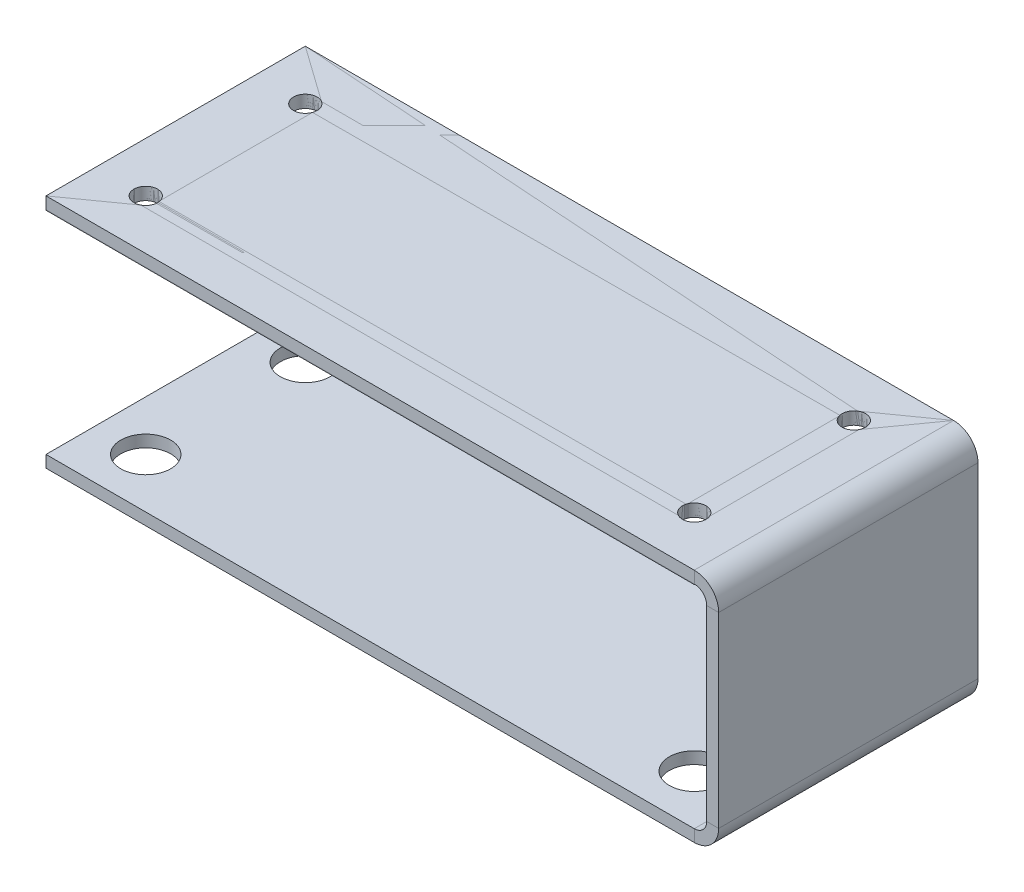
ISO-10303-21;
HEADER;
FILE_DESCRIPTION(('STEP AP214'),'2;1');
FILE_NAME('part.step','',(''),(''),'','','');
FILE_SCHEMA(('AUTOMOTIVE_DESIGN { 1 0 10303 214 1 1 1 1 }'));
ENDSEC;
DATA;
#1=APPLICATION_CONTEXT('core data for automotive mechanical design processes');
#2=APPLICATION_PROTOCOL_DEFINITION('international standard','automotive_design',2000,#1);
#3=PRODUCT_CONTEXT('',#1,'mechanical');
#4=PRODUCT('Part','Part','',(#3));
#5=PRODUCT_RELATED_PRODUCT_CATEGORY('part','',(#4));
#6=PRODUCT_DEFINITION_FORMATION('','',#4);
#7=PRODUCT_DEFINITION_CONTEXT('part definition',#1,'design');
#8=PRODUCT_DEFINITION('design','',#6,#7);
#9=PRODUCT_DEFINITION_SHAPE('','',#8);
#10=(LENGTH_UNIT() NAMED_UNIT(*) SI_UNIT(.MILLI.,.METRE.));
#11=(NAMED_UNIT(*) PLANE_ANGLE_UNIT() SI_UNIT($,.RADIAN.));
#12=(NAMED_UNIT(*) SI_UNIT($,.STERADIAN.) SOLID_ANGLE_UNIT());
#13=UNCERTAINTY_MEASURE_WITH_UNIT(LENGTH_MEASURE(1.E-05),#10,'distance_accuracy_value','');
#14=(GEOMETRIC_REPRESENTATION_CONTEXT(3) GLOBAL_UNCERTAINTY_ASSIGNED_CONTEXT((#13)) GLOBAL_UNIT_ASSIGNED_CONTEXT((#10,
#11,#12)) REPRESENTATION_CONTEXT('',''));
#15=CARTESIAN_POINT('',(0.,0.,0.));
#16=DIRECTION('',(0.,0.,1.));
#17=DIRECTION('',(1.,0.,0.));
#18=AXIS2_PLACEMENT_3D('',#15,#16,#17);
#19=CARTESIAN_POINT('',(0.,1.5875,-33.02));
#20=DIRECTION('',(0.,0.,1.));
#21=DIRECTION('',(-1.,0.,0.));
#22=AXIS2_PLACEMENT_3D('',#19,#20,#21);
#23=PLANE('',#22);
#24=DIRECTION('',(0.,1.,0.));
#25=VECTOR('',#24,1.);
#26=CARTESIAN_POINT('',(82.55,1.5875,-33.02));
#27=LINE('',#26,#25);
#28=CARTESIAN_POINT('',(82.55,0.063499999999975,-33.02));
#29=VERTEX_POINT('',#28);
#30=CARTESIAN_POINT('',(82.55,1.5875,-33.02));
#31=VERTEX_POINT('',#30);
#32=EDGE_CURVE('E106',#29,#31,#27,.T.);
#33=ORIENTED_EDGE('',*,*,#32,.F.);
#34=DIRECTION('',(1.,0.,0.));
#35=VECTOR('',#34,1.);
#36=CARTESIAN_POINT('',(0.,0.0635,-33.02));
#37=LINE('',#36,#35);
#38=CARTESIAN_POINT('',(0.,0.0635,-33.02));
#39=VERTEX_POINT('',#38);
#40=EDGE_CURVE('E243',#29,#39,#37,.F.);
#41=ORIENTED_EDGE('',*,*,#40,.T.);
#42=DIRECTION('',(0.,1.,0.));
#43=VECTOR('',#42,1.);
#44=CARTESIAN_POINT('',(0.,1.5875,-33.02));
#45=LINE('',#44,#43);
#46=CARTESIAN_POINT('',(0.,1.5875,-33.02));
#47=VERTEX_POINT('',#46);
#48=EDGE_CURVE('E114',#39,#47,#45,.T.);
#49=ORIENTED_EDGE('',*,*,#48,.T.);
#50=DIRECTION('',(-1.,0.,0.));
#51=VECTOR('',#50,1.);
#52=CARTESIAN_POINT('',(0.,1.5875,-33.02));
#53=LINE('',#52,#51);
#54=EDGE_CURVE('E226',#31,#47,#53,.T.);
#55=ORIENTED_EDGE('',*,*,#54,.F.);
#56=EDGE_LOOP('',(#33,#41,#49,#55));
#57=FACE_BOUND('',#56,.T.);
#58=ADVANCED_FACE('F96',(#57),#23,.F.);
#59=CARTESIAN_POINT('',(0.,1.5875,0.));
#60=DIRECTION('',(1.,0.,0.));
#61=DIRECTION('',(0.,0.,1.));
#62=AXIS2_PLACEMENT_3D('',#59,#60,#61);
#63=PLANE('',#62);
#64=ORIENTED_EDGE('',*,*,#48,.F.);
#65=DIRECTION('',(0.,0.,-1.));
#66=VECTOR('',#65,1.);
#67=CARTESIAN_POINT('',(0.,0.0635,0.));
#68=LINE('',#67,#66);
#69=CARTESIAN_POINT('',(0.,0.0635,0.));
#70=VERTEX_POINT('',#69);
#71=EDGE_CURVE('E240',#39,#70,#68,.F.);
#72=ORIENTED_EDGE('',*,*,#71,.T.);
#73=DIRECTION('',(0.,1.,0.));
#74=VECTOR('',#73,1.);
#75=CARTESIAN_POINT('',(0.,1.5875,0.));
#76=LINE('',#75,#74);
#77=CARTESIAN_POINT('',(0.,1.5875,0.));
#78=VERTEX_POINT('',#77);
#79=EDGE_CURVE('E100',#70,#78,#76,.T.);
#80=ORIENTED_EDGE('',*,*,#79,.T.);
#81=DIRECTION('',(0.,0.,1.));
#82=VECTOR('',#81,1.);
#83=CARTESIAN_POINT('',(0.,1.5875,0.));
#84=LINE('',#83,#82);
#85=EDGE_CURVE('E219',#47,#78,#84,.T.);
#86=ORIENTED_EDGE('',*,*,#85,.F.);
#87=EDGE_LOOP('',(#64,#72,#80,#86));
#88=FACE_BOUND('',#87,.T.);
#89=ADVANCED_FACE('F263',(#88),#63,.F.);
#90=CARTESIAN_POINT('',(76.2000000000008,1.5875,-6.34999983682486));
#91=DIRECTION('',(0.,1.,0.));
#92=DIRECTION('',(0.,0.,1.));
#93=AXIS2_PLACEMENT_3D('',#90,#91,#92);
#94=CYLINDRICAL_SURFACE('',#93,1.5);
#95=CARTESIAN_POINT('',(76.2000000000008,1.5875,-6.34999983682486));
#96=DIRECTION('',(0.,1.,0.));
#97=DIRECTION('',(0.,0.,1.));
#98=AXIS2_PLACEMENT_3D('',#95,#96,#97);
#99=CIRCLE('',#98,1.5);
#100=CARTESIAN_POINT('',(76.2000000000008,1.5875,-4.84999983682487));
#101=VERTEX_POINT('',#100);
#102=EDGE_CURVE('E212',#101,#101,#99,.T.);
#103=ORIENTED_EDGE('',*,*,#102,.T.);
#104=EDGE_LOOP('',(#103));
#105=FACE_BOUND('',#104,.T.);
#106=CARTESIAN_POINT('',(76.2000000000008,0.0635,-6.34999983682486));
#107=DIRECTION('',(0.,1.,0.));
#108=DIRECTION('',(0.,0.,1.));
#109=AXIS2_PLACEMENT_3D('',#106,#107,#108);
#110=CIRCLE('',#109,1.5);
#111=CARTESIAN_POINT('',(76.2000000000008,0.0635,-4.84999983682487));
#112=VERTEX_POINT('',#111);
#113=EDGE_CURVE('E208',#112,#112,#110,.T.);
#114=ORIENTED_EDGE('',*,*,#113,.F.);
#115=EDGE_LOOP('',(#114));
#116=FACE_BOUND('',#115,.T.);
#117=ADVANCED_FACE('F268',(#105,#116),#94,.F.);
#118=CARTESIAN_POINT('',(6.35,1.5875,-26.67));
#119=DIRECTION('',(0.,1.,0.));
#120=DIRECTION('',(0.,0.,1.));
#121=AXIS2_PLACEMENT_3D('',#118,#119,#120);
#122=CYLINDRICAL_SURFACE('',#121,1.5);
#123=CARTESIAN_POINT('',(6.35,1.5875,-26.67));
#124=DIRECTION('',(0.,1.,0.));
#125=DIRECTION('',(0.,0.,1.));
#126=AXIS2_PLACEMENT_3D('',#123,#124,#125);
#127=CIRCLE('',#126,1.5);
#128=CARTESIAN_POINT('',(6.35,1.5875,-25.17));
#129=VERTEX_POINT('',#128);
#130=EDGE_CURVE('E215',#129,#129,#127,.T.);
#131=ORIENTED_EDGE('',*,*,#130,.T.);
#132=EDGE_LOOP('',(#131));
#133=FACE_BOUND('',#132,.T.);
#134=CARTESIAN_POINT('',(6.35,0.0635,-26.67));
#135=DIRECTION('',(0.,1.,0.));
#136=DIRECTION('',(0.,0.,1.));
#137=AXIS2_PLACEMENT_3D('',#134,#135,#136);
#138=CIRCLE('',#137,1.5);
#139=CARTESIAN_POINT('',(6.35,0.0635,-25.17));
#140=VERTEX_POINT('',#139);
#141=EDGE_CURVE('E237',#140,#140,#138,.T.);
#142=ORIENTED_EDGE('',*,*,#141,.F.);
#143=EDGE_LOOP('',(#142));
#144=FACE_BOUND('',#143,.T.);
#145=ADVANCED_FACE('F275',(#133,#144),#122,.F.);
#146=CARTESIAN_POINT('',(0.,1.5875,0.));
#147=DIRECTION('',(0.,0.,-1.));
#148=DIRECTION('',(1.,0.,0.));
#149=AXIS2_PLACEMENT_3D('',#146,#147,#148);
#150=PLANE('',#149);
#151=DIRECTION('',(1.,0.,0.));
#152=VECTOR('',#151,1.);
#153=CARTESIAN_POINT('',(0.,0.0635,0.));
#154=LINE('',#153,#152);
#155=CARTESIAN_POINT('',(82.55,0.063499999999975,0.));
#156=VERTEX_POINT('',#155);
#157=EDGE_CURVE('E242',#70,#156,#154,.T.);
#158=ORIENTED_EDGE('',*,*,#157,.T.);
#159=DIRECTION('',(0.,1.,0.));
#160=VECTOR('',#159,1.);
#161=CARTESIAN_POINT('',(82.55,1.5875,0.));
#162=LINE('',#161,#160);
#163=CARTESIAN_POINT('',(82.55,1.58749999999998,0.));
#164=VERTEX_POINT('',#163);
#165=EDGE_CURVE('E14',#156,#164,#162,.T.);
#166=ORIENTED_EDGE('',*,*,#165,.T.);
#167=DIRECTION('',(1.,0.,0.));
#168=VECTOR('',#167,1.);
#169=CARTESIAN_POINT('',(0.,1.5875,0.));
#170=LINE('',#169,#168);
#171=EDGE_CURVE('E222',#78,#164,#170,.T.);
#172=ORIENTED_EDGE('',*,*,#171,.F.);
#173=ORIENTED_EDGE('',*,*,#79,.F.);
#174=EDGE_LOOP('',(#158,#166,#172,#173));
#175=FACE_BOUND('',#174,.T.);
#176=ADVANCED_FACE('F272',(#175),#150,.F.);
#177=CARTESIAN_POINT('',(76.2,1.5875,-26.67));
#178=DIRECTION('',(0.,1.,0.));
#179=DIRECTION('',(0.,0.,1.));
#180=AXIS2_PLACEMENT_3D('',#177,#178,#179);
#181=CYLINDRICAL_SURFACE('',#180,1.5);
#182=CARTESIAN_POINT('',(76.2,1.5875,-26.67));
#183=DIRECTION('',(0.,1.,0.));
#184=DIRECTION('',(0.,0.,1.));
#185=AXIS2_PLACEMENT_3D('',#182,#183,#184);
#186=CIRCLE('',#185,1.5);
#187=CARTESIAN_POINT('',(76.2,1.5875,-25.17));
#188=VERTEX_POINT('',#187);
#189=EDGE_CURVE('E229',#188,#188,#186,.T.);
#190=ORIENTED_EDGE('',*,*,#189,.T.);
#191=EDGE_LOOP('',(#190));
#192=FACE_BOUND('',#191,.T.);
#193=CARTESIAN_POINT('',(76.2,0.0635,-26.67));
#194=DIRECTION('',(0.,1.,0.));
#195=DIRECTION('',(0.,0.,1.));
#196=AXIS2_PLACEMENT_3D('',#193,#194,#195);
#197=CIRCLE('',#196,1.5);
#198=CARTESIAN_POINT('',(76.2,0.0635,-25.17));
#199=VERTEX_POINT('',#198);
#200=EDGE_CURVE('E245',#199,#199,#197,.T.);
#201=ORIENTED_EDGE('',*,*,#200,.F.);
#202=EDGE_LOOP('',(#201));
#203=FACE_BOUND('',#202,.T.);
#204=ADVANCED_FACE('F274',(#192,#203),#181,.F.);
#205=CARTESIAN_POINT('',(6.35000000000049,1.5875,-6.34999983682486));
#206=DIRECTION('',(0.,1.,0.));
#207=DIRECTION('',(0.,0.,1.));
#208=AXIS2_PLACEMENT_3D('',#205,#206,#207);
#209=CYLINDRICAL_SURFACE('',#208,1.5);
#210=CARTESIAN_POINT('',(6.35000000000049,1.5875,-6.34999983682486));
#211=DIRECTION('',(0.,1.,0.));
#212=DIRECTION('',(0.,0.,1.));
#213=AXIS2_PLACEMENT_3D('',#210,#211,#212);
#214=CIRCLE('',#213,1.5);
#215=CARTESIAN_POINT('',(6.35000000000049,1.5875,-4.84999983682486));
#216=VERTEX_POINT('',#215);
#217=EDGE_CURVE('E232',#216,#216,#214,.T.);
#218=ORIENTED_EDGE('',*,*,#217,.T.);
#219=EDGE_LOOP('',(#218));
#220=FACE_BOUND('',#219,.T.);
#221=CARTESIAN_POINT('',(6.35000000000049,0.0635,-6.34999983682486));
#222=DIRECTION('',(0.,1.,0.));
#223=DIRECTION('',(0.,0.,1.));
#224=AXIS2_PLACEMENT_3D('',#221,#222,#223);
#225=CIRCLE('',#224,1.5);
#226=CARTESIAN_POINT('',(6.35000000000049,0.0635,-4.84999983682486));
#227=VERTEX_POINT('',#226);
#228=EDGE_CURVE('E216',#227,#227,#225,.T.);
#229=ORIENTED_EDGE('',*,*,#228,.F.);
#230=EDGE_LOOP('',(#229));
#231=FACE_BOUND('',#230,.T.);
#232=ADVANCED_FACE('F98',(#220,#231),#209,.F.);
#233=CARTESIAN_POINT('',(0.,1.5875,0.));
#234=DIRECTION('',(0.,-1.,0.));
#235=DIRECTION('',(0.,0.,-1.));
#236=AXIS2_PLACEMENT_3D('',#233,#234,#235);
#237=PLANE('',#236);
#238=ORIENTED_EDGE('',*,*,#102,.F.);
#239=EDGE_LOOP('',(#238));
#240=FACE_BOUND('',#239,.T.);
#241=ORIENTED_EDGE('',*,*,#130,.F.);
#242=EDGE_LOOP('',(#241));
#243=FACE_BOUND('',#242,.T.);
#244=ORIENTED_EDGE('',*,*,#85,.T.);
#245=ORIENTED_EDGE('',*,*,#171,.T.);
#246=DIRECTION('',(0.,0.,-1.));
#247=VECTOR('',#246,1.);
#248=CARTESIAN_POINT('',(82.55,1.5875,0.));
#249=LINE('',#248,#247);
#250=EDGE_CURVE('E137',#164,#31,#249,.T.);
#251=ORIENTED_EDGE('',*,*,#250,.T.);
#252=ORIENTED_EDGE('',*,*,#54,.T.);
#253=EDGE_LOOP('',(#244,#245,#251,#252));
#254=FACE_BOUND('',#253,.T.);
#255=ORIENTED_EDGE('',*,*,#189,.F.);
#256=EDGE_LOOP('',(#255));
#257=FACE_BOUND('',#256,.T.);
#258=ORIENTED_EDGE('',*,*,#217,.F.);
#259=EDGE_LOOP('',(#258));
#260=FACE_BOUND('',#259,.T.);
#261=ADVANCED_FACE('F260',(#240,#243,#254,#257,#260),#237,.F.);
#262=CARTESIAN_POINT('',(0.,0.0635,0.));
#263=DIRECTION('',(0.,-1.,0.));
#264=DIRECTION('',(0.,0.,-1.));
#265=AXIS2_PLACEMENT_3D('',#262,#263,#264);
#266=PLANE('',#265);
#267=ORIENTED_EDGE('',*,*,#113,.T.);
#268=EDGE_LOOP('',(#267));
#269=FACE_BOUND('',#268,.T.);
#270=ORIENTED_EDGE('',*,*,#141,.T.);
#271=EDGE_LOOP('',(#270));
#272=FACE_BOUND('',#271,.T.);
#273=ORIENTED_EDGE('',*,*,#71,.F.);
#274=ORIENTED_EDGE('',*,*,#40,.F.);
#275=DIRECTION('',(0.,0.,-1.));
#276=VECTOR('',#275,1.);
#277=CARTESIAN_POINT('',(82.55,0.0635,0.));
#278=LINE('',#277,#276);
#279=EDGE_CURVE('E246',#156,#29,#278,.T.);
#280=ORIENTED_EDGE('',*,*,#279,.F.);
#281=ORIENTED_EDGE('',*,*,#157,.F.);
#282=EDGE_LOOP('',(#273,#274,#280,#281));
#283=FACE_BOUND('',#282,.T.);
#284=ORIENTED_EDGE('',*,*,#200,.T.);
#285=EDGE_LOOP('',(#284));
#286=FACE_BOUND('',#285,.T.);
#287=ORIENTED_EDGE('',*,*,#228,.T.);
#288=EDGE_LOOP('',(#287));
#289=FACE_BOUND('',#288,.T.);
#290=ADVANCED_FACE('F286',(#269,#272,#283,#286,#289),#266,.T.);
#291=CARTESIAN_POINT('',(82.55,-1.524,-33.02));
#292=DIRECTION('',(0.,0.,-1.));
#293=DIRECTION('',(-1.,0.,0.));
#294=AXIS2_PLACEMENT_3D('',#291,#292,#293);
#295=PLANE('',#294);
#296=DIRECTION('',(1.,0.,0.));
#297=VECTOR('',#296,1.);
#298=CARTESIAN_POINT('',(85.6615,-1.52399999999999,-33.02));
#299=LINE('',#298,#297);
#300=CARTESIAN_POINT('',(84.1375,-1.524,-33.02));
#301=VERTEX_POINT('',#300);
#302=CARTESIAN_POINT('',(85.6615,-1.52399999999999,-33.02));
#303=VERTEX_POINT('',#302);
#304=EDGE_CURVE('E171',#301,#303,#299,.T.);
#305=ORIENTED_EDGE('',*,*,#304,.F.);
#306=CARTESIAN_POINT('',(82.55,-1.524,-33.02));
#307=DIRECTION('',(0.,0.,1.));
#308=DIRECTION('',(1.,0.,0.));
#309=AXIS2_PLACEMENT_3D('',#306,#307,#308);
#310=CIRCLE('',#309,1.58749999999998);
#311=EDGE_CURVE('E165',#29,#301,#310,.F.);
#312=ORIENTED_EDGE('',*,*,#311,.F.);
#313=ORIENTED_EDGE('',*,*,#32,.T.);
#314=CARTESIAN_POINT('',(82.55,-1.524,-33.02));
#315=DIRECTION('',(0.,0.,1.));
#316=DIRECTION('',(1.,0.,0.));
#317=AXIS2_PLACEMENT_3D('',#314,#315,#316);
#318=CIRCLE('',#317,3.11149999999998);
#319=EDGE_CURVE('E205',#31,#303,#318,.F.);
#320=ORIENTED_EDGE('',*,*,#319,.T.);
#321=EDGE_LOOP('',(#305,#312,#313,#320));
#322=FACE_BOUND('',#321,.T.);
#323=ADVANCED_FACE('F257',(#322),#295,.T.);
#324=CARTESIAN_POINT('',(82.55,-1.524,0.));
#325=DIRECTION('',(0.,0.,-1.));
#326=DIRECTION('',(-1.,0.,0.));
#327=AXIS2_PLACEMENT_3D('',#324,#325,#326);
#328=PLANE('',#327);
#329=CARTESIAN_POINT('',(82.55,-1.524,0.));
#330=DIRECTION('',(0.,0.,1.));
#331=DIRECTION('',(1.,0.,0.));
#332=AXIS2_PLACEMENT_3D('',#329,#330,#331);
#333=CIRCLE('',#332,1.58749999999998);
#334=CARTESIAN_POINT('',(84.1375,-1.524,0.));
#335=VERTEX_POINT('',#334);
#336=EDGE_CURVE('E162',#335,#156,#333,.T.);
#337=ORIENTED_EDGE('',*,*,#336,.F.);
#338=DIRECTION('',(1.,0.,0.));
#339=VECTOR('',#338,1.);
#340=CARTESIAN_POINT('',(84.1375,-1.524,0.));
#341=LINE('',#340,#339);
#342=CARTESIAN_POINT('',(85.6615,-1.52399999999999,0.));
#343=VERTEX_POINT('',#342);
#344=EDGE_CURVE('E170',#335,#343,#341,.T.);
#345=ORIENTED_EDGE('',*,*,#344,.T.);
#346=CARTESIAN_POINT('',(82.55,-1.524,0.));
#347=DIRECTION('',(0.,0.,1.));
#348=DIRECTION('',(1.,0.,0.));
#349=AXIS2_PLACEMENT_3D('',#346,#347,#348);
#350=CIRCLE('',#349,3.11149999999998);
#351=EDGE_CURVE('E209',#343,#164,#350,.T.);
#352=ORIENTED_EDGE('',*,*,#351,.T.);
#353=ORIENTED_EDGE('',*,*,#165,.F.);
#354=EDGE_LOOP('',(#337,#345,#352,#353));
#355=FACE_BOUND('',#354,.T.);
#356=ADVANCED_FACE('F175',(#355),#328,.F.);
#357=CARTESIAN_POINT('',(82.55,-1.524,0.));
#358=DIRECTION('',(0.,0.,1.));
#359=DIRECTION('',(1.,0.,0.));
#360=AXIS2_PLACEMENT_3D('',#357,#358,#359);
#361=CYLINDRICAL_SURFACE('',#360,3.11149999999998);
#362=ORIENTED_EDGE('',*,*,#250,.F.);
#363=ORIENTED_EDGE('',*,*,#351,.F.);
#364=DIRECTION('',(0.,0.,1.));
#365=VECTOR('',#364,1.);
#366=CARTESIAN_POINT('',(85.6615,-1.52399999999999,0.));
#367=LINE('',#366,#365);
#368=EDGE_CURVE('E196',#303,#343,#367,.T.);
#369=ORIENTED_EDGE('',*,*,#368,.F.);
#370=ORIENTED_EDGE('',*,*,#319,.F.);
#371=EDGE_LOOP('',(#362,#363,#369,#370));
#372=FACE_BOUND('',#371,.T.);
#373=ADVANCED_FACE('F354',(#372),#361,.T.);
#374=CARTESIAN_POINT('',(82.55,-1.524,0.));
#375=DIRECTION('',(0.,0.,1.));
#376=DIRECTION('',(1.,0.,0.));
#377=AXIS2_PLACEMENT_3D('',#374,#375,#376);
#378=CYLINDRICAL_SURFACE('',#377,1.58749999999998);
#379=ORIENTED_EDGE('',*,*,#279,.T.);
#380=ORIENTED_EDGE('',*,*,#311,.T.);
#381=DIRECTION('',(0.,0.,-1.));
#382=VECTOR('',#381,1.);
#383=CARTESIAN_POINT('',(84.1375,-1.524,-33.02));
#384=LINE('',#383,#382);
#385=EDGE_CURVE('E159',#301,#335,#384,.F.);
#386=ORIENTED_EDGE('',*,*,#385,.T.);
#387=ORIENTED_EDGE('',*,*,#336,.T.);
#388=EDGE_LOOP('',(#379,#380,#386,#387));
#389=FACE_BOUND('',#388,.T.);
#390=ADVANCED_FACE('F161',(#389),#378,.F.);
#391=CARTESIAN_POINT('',(85.6615,0.0635000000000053,0.));
#392=DIRECTION('',(0.,0.,1.));
#393=DIRECTION('',(0.,-1.,0.));
#394=AXIS2_PLACEMENT_3D('',#391,#392,#393);
#395=PLANE('',#394);
#396=DIRECTION('',(0.,1.,0.));
#397=VECTOR('',#396,1.);
#398=CARTESIAN_POINT('',(85.6615,0.0635000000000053,0.));
#399=LINE('',#398,#397);
#400=CARTESIAN_POINT('',(85.6615000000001,-25.3365,0.));
#401=VERTEX_POINT('',#400);
#402=EDGE_CURVE('E195',#401,#343,#399,.T.);
#403=ORIENTED_EDGE('',*,*,#402,.T.);
#404=ORIENTED_EDGE('',*,*,#344,.F.);
#405=DIRECTION('',(0.,-1.,0.));
#406=VECTOR('',#405,1.);
#407=CARTESIAN_POINT('',(84.1375,2.70616862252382E-13,0.));
#408=LINE('',#407,#406);
#409=CARTESIAN_POINT('',(84.1375000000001,-25.3365,0.));
#410=VERTEX_POINT('',#409);
#411=EDGE_CURVE('E182',#410,#335,#408,.F.);
#412=ORIENTED_EDGE('',*,*,#411,.F.);
#413=DIRECTION('',(-1.,0.,0.));
#414=VECTOR('',#413,1.);
#415=CARTESIAN_POINT('',(85.6615000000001,-25.3365,0.));
#416=LINE('',#415,#414);
#417=EDGE_CURVE('E178',#401,#410,#416,.T.);
#418=ORIENTED_EDGE('',*,*,#417,.F.);
#419=EDGE_LOOP('',(#403,#404,#412,#418));
#420=FACE_BOUND('',#419,.T.);
#421=ADVANCED_FACE('F193',(#420),#395,.T.);
#422=CARTESIAN_POINT('',(85.6615000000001,-25.3365,-33.02));
#423=DIRECTION('',(0.,0.,-1.));
#424=DIRECTION('',(-1.,0.,0.));
#425=AXIS2_PLACEMENT_3D('',#422,#423,#424);
#426=PLANE('',#425);
#427=DIRECTION('',(0.,1.,0.));
#428=VECTOR('',#427,1.);
#429=CARTESIAN_POINT('',(84.1375,2.70616862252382E-13,-33.02));
#430=LINE('',#429,#428);
#431=CARTESIAN_POINT('',(84.1375000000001,-25.3365,-33.02));
#432=VERTEX_POINT('',#431);
#433=EDGE_CURVE('E198',#301,#432,#430,.F.);
#434=ORIENTED_EDGE('',*,*,#433,.F.);
#435=ORIENTED_EDGE('',*,*,#304,.T.);
#436=DIRECTION('',(0.,-1.,0.));
#437=VECTOR('',#436,1.);
#438=CARTESIAN_POINT('',(85.6615000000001,-25.3365,-33.02));
#439=LINE('',#438,#437);
#440=CARTESIAN_POINT('',(85.6615000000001,-25.3365,-33.02));
#441=VERTEX_POINT('',#440);
#442=EDGE_CURVE('E190',#303,#441,#439,.T.);
#443=ORIENTED_EDGE('',*,*,#442,.T.);
#444=DIRECTION('',(-1.,0.,0.));
#445=VECTOR('',#444,1.);
#446=CARTESIAN_POINT('',(85.6615000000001,-25.3365,-33.02));
#447=LINE('',#446,#445);
#448=EDGE_CURVE('E674',#441,#432,#447,.T.);
#449=ORIENTED_EDGE('',*,*,#448,.T.);
#450=EDGE_LOOP('',(#434,#435,#443,#449));
#451=FACE_BOUND('',#450,.T.);
#452=ADVANCED_FACE('F381',(#451),#426,.T.);
#453=CARTESIAN_POINT('',(85.6615,2.75937879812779E-13,0.));
#454=DIRECTION('',(1.,0.,0.));
#455=DIRECTION('',(0.,1.,0.));
#456=AXIS2_PLACEMENT_3D('',#453,#454,#455);
#457=PLANE('',#456);
#458=ORIENTED_EDGE('',*,*,#442,.F.);
#459=ORIENTED_EDGE('',*,*,#368,.T.);
#460=ORIENTED_EDGE('',*,*,#402,.F.);
#461=DIRECTION('',(0.,0.,1.));
#462=VECTOR('',#461,1.);
#463=CARTESIAN_POINT('',(85.6615000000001,-25.3365,0.));
#464=LINE('',#463,#462);
#465=EDGE_CURVE('E678',#441,#401,#464,.T.);
#466=ORIENTED_EDGE('',*,*,#465,.F.);
#467=EDGE_LOOP('',(#458,#459,#460,#466));
#468=FACE_BOUND('',#467,.T.);
#469=ADVANCED_FACE('F391',(#468),#457,.T.);
#470=CARTESIAN_POINT('',(84.1375,2.70616862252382E-13,0.));
#471=DIRECTION('',(1.,0.,0.));
#472=DIRECTION('',(0.,1.,0.));
#473=AXIS2_PLACEMENT_3D('',#470,#471,#472);
#474=PLANE('',#473);
#475=ORIENTED_EDGE('',*,*,#385,.F.);
#476=ORIENTED_EDGE('',*,*,#433,.T.);
#477=DIRECTION('',(0.,0.,-1.));
#478=VECTOR('',#477,1.);
#479=CARTESIAN_POINT('',(84.1375000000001,-25.3365,0.));
#480=LINE('',#479,#478);
#481=EDGE_CURVE('E186',#432,#410,#480,.F.);
#482=ORIENTED_EDGE('',*,*,#481,.T.);
#483=ORIENTED_EDGE('',*,*,#411,.T.);
#484=EDGE_LOOP('',(#475,#476,#482,#483));
#485=FACE_BOUND('',#484,.T.);
#486=ADVANCED_FACE('F183',(#485),#474,.F.);
#487=CARTESIAN_POINT('',(82.5500000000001,-25.3365,-33.02));
#488=DIRECTION('',(0.,0.,-1.));
#489=DIRECTION('',(-1.,0.,0.));
#490=AXIS2_PLACEMENT_3D('',#487,#488,#489);
#491=PLANE('',#490);
#492=DIRECTION('',(0.,1.,0.));
#493=VECTOR('',#492,1.);
#494=CARTESIAN_POINT('',(82.5500000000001,-28.448,-33.02));
#495=LINE('',#494,#493);
#496=CARTESIAN_POINT('',(82.5500000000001,-26.924,-33.02));
#497=VERTEX_POINT('',#496);
#498=CARTESIAN_POINT('',(82.5500000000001,-28.448,-33.02));
#499=VERTEX_POINT('',#498);
#500=EDGE_CURVE('E658',#497,#499,#495,.F.);
#501=ORIENTED_EDGE('',*,*,#500,.F.);
#502=CARTESIAN_POINT('',(82.5500000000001,-25.3365,-33.02));
#503=DIRECTION('',(0.,0.,1.));
#504=DIRECTION('',(1.,0.,0.));
#505=AXIS2_PLACEMENT_3D('',#502,#503,#504);
#506=CIRCLE('',#505,1.5875);
#507=EDGE_CURVE('E666',#432,#497,#506,.F.);
#508=ORIENTED_EDGE('',*,*,#507,.F.);
#509=ORIENTED_EDGE('',*,*,#448,.F.);
#510=CARTESIAN_POINT('',(82.5500000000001,-25.3365,-33.02));
#511=DIRECTION('',(0.,0.,1.));
#512=DIRECTION('',(1.,0.,0.));
#513=AXIS2_PLACEMENT_3D('',#510,#511,#512);
#514=CIRCLE('',#513,3.1115);
#515=EDGE_CURVE('E204',#441,#499,#514,.F.);
#516=ORIENTED_EDGE('',*,*,#515,.T.);
#517=EDGE_LOOP('',(#501,#508,#509,#516));
#518=FACE_BOUND('',#517,.T.);
#519=ADVANCED_FACE('F412',(#518),#491,.T.);
#520=CARTESIAN_POINT('',(82.5500000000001,-25.3365,0.));
#521=DIRECTION('',(0.,0.,-1.));
#522=DIRECTION('',(-1.,0.,0.));
#523=AXIS2_PLACEMENT_3D('',#520,#521,#522);
#524=PLANE('',#523);
#525=CARTESIAN_POINT('',(82.5500000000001,-25.3365,0.));
#526=DIRECTION('',(0.,0.,1.));
#527=DIRECTION('',(1.,0.,0.));
#528=AXIS2_PLACEMENT_3D('',#525,#526,#527);
#529=CIRCLE('',#528,1.5875);
#530=CARTESIAN_POINT('',(82.5500000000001,-26.924,0.));
#531=VERTEX_POINT('',#530);
#532=EDGE_CURVE('E669',#531,#410,#529,.T.);
#533=ORIENTED_EDGE('',*,*,#532,.F.);
#534=DIRECTION('',(0.,1.,0.));
#535=VECTOR('',#534,1.);
#536=CARTESIAN_POINT('',(82.5500000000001,-26.924,0.));
#537=LINE('',#536,#535);
#538=CARTESIAN_POINT('',(82.5500000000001,-28.448,0.));
#539=VERTEX_POINT('',#538);
#540=EDGE_CURVE('E649',#531,#539,#537,.F.);
#541=ORIENTED_EDGE('',*,*,#540,.T.);
#542=CARTESIAN_POINT('',(82.5500000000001,-25.3365,0.));
#543=DIRECTION('',(0.,0.,1.));
#544=DIRECTION('',(1.,0.,0.));
#545=AXIS2_PLACEMENT_3D('',#542,#543,#544);
#546=CIRCLE('',#545,3.1115);
#547=EDGE_CURVE('E663',#539,#401,#546,.T.);
#548=ORIENTED_EDGE('',*,*,#547,.T.);
#549=ORIENTED_EDGE('',*,*,#417,.T.);
#550=EDGE_LOOP('',(#533,#541,#548,#549));
#551=FACE_BOUND('',#550,.T.);
#552=ADVANCED_FACE('F422',(#551),#524,.F.);
#553=CARTESIAN_POINT('',(82.5500000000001,-25.3365,0.));
#554=DIRECTION('',(0.,0.,1.));
#555=DIRECTION('',(0.,-1.,0.));
#556=AXIS2_PLACEMENT_3D('',#553,#554,#555);
#557=CYLINDRICAL_SURFACE('',#556,3.1115);
#558=ORIENTED_EDGE('',*,*,#465,.T.);
#559=ORIENTED_EDGE('',*,*,#547,.F.);
#560=DIRECTION('',(0.,0.,1.));
#561=VECTOR('',#560,1.);
#562=CARTESIAN_POINT('',(82.5500000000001,-28.448,-33.02));
#563=LINE('',#562,#561);
#564=EDGE_CURVE('E644',#539,#499,#563,.F.);
#565=ORIENTED_EDGE('',*,*,#564,.T.);
#566=ORIENTED_EDGE('',*,*,#515,.F.);
#567=EDGE_LOOP('',(#558,#559,#565,#566));
#568=FACE_BOUND('',#567,.T.);
#569=ADVANCED_FACE('F433',(#568),#557,.T.);
#570=CARTESIAN_POINT('',(82.5500000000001,-25.3365,0.));
#571=DIRECTION('',(0.,0.,1.));
#572=DIRECTION('',(0.,-1.,0.));
#573=AXIS2_PLACEMENT_3D('',#570,#571,#572);
#574=CYLINDRICAL_SURFACE('',#573,1.5875);
#575=ORIENTED_EDGE('',*,*,#481,.F.);
#576=ORIENTED_EDGE('',*,*,#507,.T.);
#577=DIRECTION('',(0.,0.,1.));
#578=VECTOR('',#577,1.);
#579=CARTESIAN_POINT('',(82.5500000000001,-26.924,-33.02));
#580=LINE('',#579,#578);
#581=EDGE_CURVE('E655',#497,#531,#580,.T.);
#582=ORIENTED_EDGE('',*,*,#581,.T.);
#583=ORIENTED_EDGE('',*,*,#532,.T.);
#584=EDGE_LOOP('',(#575,#576,#582,#583));
#585=FACE_BOUND('',#584,.T.);
#586=ADVANCED_FACE('F444',(#585),#574,.F.);
#587=CARTESIAN_POINT('',(1.86862120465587E-13,-28.4480000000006,0.));
#588=DIRECTION('',(0.,1.,0.));
#589=DIRECTION('',(-1.,0.,0.));
#590=AXIS2_PLACEMENT_3D('',#587,#588,#589);
#591=PLANE('',#590);
#592=CARTESIAN_POINT('',(76.2000000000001,-28.448,-6.34999999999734));
#593=DIRECTION('',(0.,1.,0.));
#594=DIRECTION('',(-1.,0.,0.));
#595=AXIS2_PLACEMENT_3D('',#592,#593,#594);
#596=CIRCLE('',#595,3.175);
#597=CARTESIAN_POINT('',(73.0250000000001,-28.4480000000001,-6.34999999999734));
#598=VERTEX_POINT('',#597);
#599=EDGE_CURVE('E640',#598,#598,#596,.F.);
#600=ORIENTED_EDGE('',*,*,#599,.F.);
#601=EDGE_LOOP('',(#600));
#602=FACE_BOUND('',#601,.T.);
#603=CARTESIAN_POINT('',(6.35000000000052,-28.4480000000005,-26.67));
#604=DIRECTION('',(0.,1.,0.));
#605=DIRECTION('',(-1.,0.,0.));
#606=AXIS2_PLACEMENT_3D('',#603,#604,#605);
#607=CIRCLE('',#606,3.175);
#608=CARTESIAN_POINT('',(3.17500000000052,-28.4480000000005,-26.67));
#609=VERTEX_POINT('',#608);
#610=EDGE_CURVE('E733',#609,#609,#607,.F.);
#611=ORIENTED_EDGE('',*,*,#610,.F.);
#612=EDGE_LOOP('',(#611));
#613=FACE_BOUND('',#612,.T.);
#614=CARTESIAN_POINT('',(6.35000000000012,-28.4480000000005,-6.35000000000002));
#615=DIRECTION('',(0.,1.,0.));
#616=DIRECTION('',(-1.,0.,0.));
#617=AXIS2_PLACEMENT_3D('',#614,#615,#616);
#618=CIRCLE('',#617,3.175);
#619=CARTESIAN_POINT('',(3.17500000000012,-28.4480000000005,-6.35000000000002));
#620=VERTEX_POINT('',#619);
#621=EDGE_CURVE('E727',#620,#620,#618,.F.);
#622=ORIENTED_EDGE('',*,*,#621,.F.);
#623=EDGE_LOOP('',(#622));
#624=FACE_BOUND('',#623,.T.);
#625=CARTESIAN_POINT('',(76.2000000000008,-28.448,-26.6699999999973));
#626=DIRECTION('',(0.,1.,0.));
#627=DIRECTION('',(-1.,0.,0.));
#628=AXIS2_PLACEMENT_3D('',#625,#626,#627);
#629=CIRCLE('',#628,3.175);
#630=CARTESIAN_POINT('',(73.0250000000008,-28.4480000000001,-26.6699999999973));
#631=VERTEX_POINT('',#630);
#632=EDGE_CURVE('E739',#631,#631,#629,.F.);
#633=ORIENTED_EDGE('',*,*,#632,.F.);
#634=EDGE_LOOP('',(#633));
#635=FACE_BOUND('',#634,.T.);
#636=ORIENTED_EDGE('',*,*,#564,.F.);
#637=DIRECTION('',(-1.,0.,0.));
#638=VECTOR('',#637,1.);
#639=CARTESIAN_POINT('',(1.86862120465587E-13,-28.4480000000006,0.));
#640=LINE('',#639,#638);
#641=CARTESIAN_POINT('',(1.12665706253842E-13,-28.4480000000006,0.));
#642=VERTEX_POINT('',#641);
#643=EDGE_CURVE('E715',#539,#642,#640,.T.);
#644=ORIENTED_EDGE('',*,*,#643,.T.);
#645=DIRECTION('',(0.,0.,-1.));
#646=VECTOR('',#645,1.);
#647=CARTESIAN_POINT('',(1.12665706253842E-13,-28.4480000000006,0.));
#648=LINE('',#647,#646);
#649=CARTESIAN_POINT('',(0.,-28.4480000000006,-33.02));
#650=VERTEX_POINT('',#649);
#651=EDGE_CURVE('E713',#642,#650,#648,.T.);
#652=ORIENTED_EDGE('',*,*,#651,.T.);
#653=DIRECTION('',(1.,0.,0.));
#654=VECTOR('',#653,1.);
#655=CARTESIAN_POINT('',(1.70522989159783E-13,-28.4480000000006,-33.02));
#656=LINE('',#655,#654);
#657=EDGE_CURVE('E703',#650,#499,#656,.T.);
#658=ORIENTED_EDGE('',*,*,#657,.T.);
#659=EDGE_LOOP('',(#636,#644,#652,#658));
#660=FACE_BOUND('',#659,.T.);
#661=ADVANCED_FACE('F455',(#602,#613,#624,#635,#660),#591,.F.);
#662=CARTESIAN_POINT('',(1.76545099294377E-13,-26.9240000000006,0.));
#663=DIRECTION('',(0.,1.,0.));
#664=DIRECTION('',(-1.,0.,0.));
#665=AXIS2_PLACEMENT_3D('',#662,#663,#664);
#666=PLANE('',#665);
#667=CARTESIAN_POINT('',(76.2000000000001,-26.924,-6.34999999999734));
#668=DIRECTION('',(0.,1.,0.));
#669=DIRECTION('',(-1.,0.,0.));
#670=AXIS2_PLACEMENT_3D('',#667,#668,#669);
#671=CIRCLE('',#670,3.175);
#672=CARTESIAN_POINT('',(73.0250000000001,-26.9240000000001,-6.34999999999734));
#673=VERTEX_POINT('',#672);
#674=EDGE_CURVE('E643',#673,#673,#671,.F.);
#675=ORIENTED_EDGE('',*,*,#674,.T.);
#676=EDGE_LOOP('',(#675));
#677=FACE_BOUND('',#676,.T.);
#678=CARTESIAN_POINT('',(6.35000000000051,-26.9240000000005,-26.67));
#679=DIRECTION('',(0.,1.,0.));
#680=DIRECTION('',(-1.,0.,0.));
#681=AXIS2_PLACEMENT_3D('',#678,#679,#680);
#682=CIRCLE('',#681,3.175);
#683=CARTESIAN_POINT('',(3.17500000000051,-26.9240000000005,-26.67));
#684=VERTEX_POINT('',#683);
#685=EDGE_CURVE('E736',#684,#684,#682,.F.);
#686=ORIENTED_EDGE('',*,*,#685,.T.);
#687=EDGE_LOOP('',(#686));
#688=FACE_BOUND('',#687,.T.);
#689=CARTESIAN_POINT('',(6.35000000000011,-26.9240000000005,-6.35000000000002));
#690=DIRECTION('',(0.,1.,0.));
#691=DIRECTION('',(-1.,0.,0.));
#692=AXIS2_PLACEMENT_3D('',#689,#690,#691);
#693=CIRCLE('',#692,3.175);
#694=CARTESIAN_POINT('',(3.17500000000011,-26.9240000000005,-6.35000000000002));
#695=VERTEX_POINT('',#694);
#696=EDGE_CURVE('E730',#695,#695,#693,.F.);
#697=ORIENTED_EDGE('',*,*,#696,.T.);
#698=EDGE_LOOP('',(#697));
#699=FACE_BOUND('',#698,.T.);
#700=CARTESIAN_POINT('',(76.2000000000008,-26.924,-26.6699999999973));
#701=DIRECTION('',(0.,1.,0.));
#702=DIRECTION('',(-1.,0.,0.));
#703=AXIS2_PLACEMENT_3D('',#700,#701,#702);
#704=CIRCLE('',#703,3.175);
#705=CARTESIAN_POINT('',(73.0250000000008,-26.9240000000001,-26.6699999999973));
#706=VERTEX_POINT('',#705);
#707=EDGE_CURVE('E646',#706,#706,#704,.F.);
#708=ORIENTED_EDGE('',*,*,#707,.T.);
#709=EDGE_LOOP('',(#708));
#710=FACE_BOUND('',#709,.T.);
#711=DIRECTION('',(1.,0.,0.));
#712=VECTOR('',#711,1.);
#713=CARTESIAN_POINT('',(1.02359484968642E-13,-26.9240000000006,0.));
#714=LINE('',#713,#712);
#715=CARTESIAN_POINT('',(1.02348685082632E-13,-26.9240000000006,0.));
#716=VERTEX_POINT('',#715);
#717=EDGE_CURVE('E720',#531,#716,#714,.F.);
#718=ORIENTED_EDGE('',*,*,#717,.F.);
#719=ORIENTED_EDGE('',*,*,#581,.F.);
#720=DIRECTION('',(-1.,0.,0.));
#721=VECTOR('',#720,1.);
#722=CARTESIAN_POINT('',(84.1375000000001,-26.924,-33.02));
#723=LINE('',#722,#721);
#724=CARTESIAN_POINT('',(0.,-26.9240000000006,-33.02));
#725=VERTEX_POINT('',#724);
#726=EDGE_CURVE('E705',#725,#497,#723,.F.);
#727=ORIENTED_EDGE('',*,*,#726,.F.);
#728=DIRECTION('',(0.,0.,1.));
#729=VECTOR('',#728,1.);
#730=CARTESIAN_POINT('',(0.,-26.9240000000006,-33.02));
#731=LINE('',#730,#729);
#732=EDGE_CURVE('E716',#716,#725,#731,.F.);
#733=ORIENTED_EDGE('',*,*,#732,.F.);
#734=EDGE_LOOP('',(#718,#719,#727,#733));
#735=FACE_BOUND('',#734,.T.);
#736=ADVANCED_FACE('F466',(#677,#688,#699,#710,#735),#666,.T.);
#737=CARTESIAN_POINT('',(84.1375000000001,-28.448,-33.02));
#738=DIRECTION('',(0.,0.,1.));
#739=DIRECTION('',(1.,0.,0.));
#740=AXIS2_PLACEMENT_3D('',#737,#738,#739);
#741=PLANE('',#740);
#742=ORIENTED_EDGE('',*,*,#500,.T.);
#743=ORIENTED_EDGE('',*,*,#657,.F.);
#744=DIRECTION('',(0.,1.,0.));
#745=VECTOR('',#744,1.);
#746=CARTESIAN_POINT('',(0.,-28.4480000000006,-33.02));
#747=LINE('',#746,#745);
#748=EDGE_CURVE('E757',#650,#725,#747,.T.);
#749=ORIENTED_EDGE('',*,*,#748,.T.);
#750=ORIENTED_EDGE('',*,*,#726,.T.);
#751=EDGE_LOOP('',(#742,#743,#749,#750));
#752=FACE_BOUND('',#751,.T.);
#753=ADVANCED_FACE('F477',(#752),#741,.F.);
#754=CARTESIAN_POINT('',(1.12665706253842E-13,-28.4480000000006,0.));
#755=DIRECTION('',(0.,0.,-1.));
#756=DIRECTION('',(-1.,0.,0.));
#757=AXIS2_PLACEMENT_3D('',#754,#755,#756);
#758=PLANE('',#757);
#759=ORIENTED_EDGE('',*,*,#540,.F.);
#760=ORIENTED_EDGE('',*,*,#717,.T.);
#761=DIRECTION('',(0.,1.,0.));
#762=VECTOR('',#761,1.);
#763=CARTESIAN_POINT('',(1.12665706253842E-13,-28.4480000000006,0.));
#764=LINE('',#763,#762);
#765=EDGE_CURVE('E672',#642,#716,#764,.T.);
#766=ORIENTED_EDGE('',*,*,#765,.F.);
#767=ORIENTED_EDGE('',*,*,#643,.F.);
#768=EDGE_LOOP('',(#759,#760,#766,#767));
#769=FACE_BOUND('',#768,.T.);
#770=ADVANCED_FACE('F488',(#769),#758,.F.);
#771=CARTESIAN_POINT('',(0.,-28.4480000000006,-33.02));
#772=DIRECTION('',(1.,0.,0.));
#773=DIRECTION('',(0.,1.,0.));
#774=AXIS2_PLACEMENT_3D('',#771,#772,#773);
#775=PLANE('',#774);
#776=ORIENTED_EDGE('',*,*,#732,.T.);
#777=ORIENTED_EDGE('',*,*,#748,.F.);
#778=ORIENTED_EDGE('',*,*,#651,.F.);
#779=ORIENTED_EDGE('',*,*,#765,.T.);
#780=EDGE_LOOP('',(#776,#777,#778,#779));
#781=FACE_BOUND('',#780,.T.);
#782=ADVANCED_FACE('F499',(#781),#775,.F.);
#783=CARTESIAN_POINT('',(6.35000000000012,-28.4480000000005,-6.35000000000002));
#784=DIRECTION('',(0.,1.,0.));
#785=DIRECTION('',(-1.,0.,0.));
#786=AXIS2_PLACEMENT_3D('',#783,#784,#785);
#787=CYLINDRICAL_SURFACE('',#786,3.175);
#788=CARTESIAN_POINT('',(3.17500000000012,-28.4480000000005,-6.35000000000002));
#789=CARTESIAN_POINT('',(3.17500000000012,-28.4321250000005,-6.35000000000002));
#790=CARTESIAN_POINT('',(3.17500000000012,-28.4162500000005,-6.35000000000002));
#791=CARTESIAN_POINT('',(3.17500000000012,-28.3845000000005,-6.35000000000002));
#792=CARTESIAN_POINT('',(3.17500000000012,-28.3686250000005,-6.35000000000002));
#793=CARTESIAN_POINT('',(3.17500000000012,-28.3368750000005,-6.35000000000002));
#794=CARTESIAN_POINT('',(3.17500000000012,-28.3210000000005,-6.35000000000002));
#795=CARTESIAN_POINT('',(3.17500000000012,-28.2892500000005,-6.35000000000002));
#796=CARTESIAN_POINT('',(3.17500000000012,-28.2733750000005,-6.35000000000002));
#797=CARTESIAN_POINT('',(3.17500000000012,-28.2416250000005,-6.35000000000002));
#798=CARTESIAN_POINT('',(3.17500000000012,-28.2257500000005,-6.35000000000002));
#799=CARTESIAN_POINT('',(3.17500000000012,-28.1940000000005,-6.35000000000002));
#800=CARTESIAN_POINT('',(3.17500000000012,-28.1781250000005,-6.35000000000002));
#801=CARTESIAN_POINT('',(3.17500000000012,-28.1463750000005,-6.35000000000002));
#802=CARTESIAN_POINT('',(3.17500000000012,-28.1305000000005,-6.35000000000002));
#803=CARTESIAN_POINT('',(3.17500000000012,-28.0987500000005,-6.35000000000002));
#804=CARTESIAN_POINT('',(3.17500000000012,-28.0828750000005,-6.35000000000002));
#805=CARTESIAN_POINT('',(3.17500000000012,-28.0511250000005,-6.35000000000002));
#806=CARTESIAN_POINT('',(3.17500000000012,-28.0352500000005,-6.35000000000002));
#807=CARTESIAN_POINT('',(3.17500000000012,-28.0035000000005,-6.35000000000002));
#808=CARTESIAN_POINT('',(3.17500000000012,-27.9876250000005,-6.35000000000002));
#809=CARTESIAN_POINT('',(3.17500000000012,-27.9558750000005,-6.35000000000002));
#810=CARTESIAN_POINT('',(3.17500000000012,-27.9400000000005,-6.35000000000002));
#811=CARTESIAN_POINT('',(3.17500000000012,-27.9082500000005,-6.35000000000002));
#812=CARTESIAN_POINT('',(3.17500000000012,-27.8923750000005,-6.35000000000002));
#813=CARTESIAN_POINT('',(3.17500000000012,-27.8606250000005,-6.35000000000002));
#814=CARTESIAN_POINT('',(3.17500000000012,-27.8447500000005,-6.35000000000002));
#815=CARTESIAN_POINT('',(3.17500000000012,-27.8130000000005,-6.35000000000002));
#816=CARTESIAN_POINT('',(3.17500000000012,-27.7971250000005,-6.35000000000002));
#817=CARTESIAN_POINT('',(3.17500000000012,-27.7653750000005,-6.35000000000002));
#818=CARTESIAN_POINT('',(3.17500000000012,-27.7495000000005,-6.35000000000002));
#819=CARTESIAN_POINT('',(3.17500000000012,-27.7177500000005,-6.35000000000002));
#820=CARTESIAN_POINT('',(3.17500000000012,-27.7018750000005,-6.35000000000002));
#821=CARTESIAN_POINT('',(3.17500000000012,-27.6701250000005,-6.35000000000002));
#822=CARTESIAN_POINT('',(3.17500000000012,-27.6542500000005,-6.35000000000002));
#823=CARTESIAN_POINT('',(3.17500000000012,-27.6225000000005,-6.35000000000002));
#824=CARTESIAN_POINT('',(3.17500000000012,-27.6066250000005,-6.35000000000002));
#825=CARTESIAN_POINT('',(3.17500000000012,-27.5748750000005,-6.35000000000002));
#826=CARTESIAN_POINT('',(3.17500000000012,-27.5590000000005,-6.35000000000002));
#827=CARTESIAN_POINT('',(3.17500000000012,-27.5272500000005,-6.35000000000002));
#828=CARTESIAN_POINT('',(3.17500000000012,-27.5113750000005,-6.35000000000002));
#829=CARTESIAN_POINT('',(3.17500000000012,-27.4796250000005,-6.35000000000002));
#830=CARTESIAN_POINT('',(3.17500000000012,-27.4637500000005,-6.35000000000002));
#831=CARTESIAN_POINT('',(3.17500000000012,-27.4320000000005,-6.35000000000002));
#832=CARTESIAN_POINT('',(3.17500000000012,-27.4161250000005,-6.35000000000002));
#833=CARTESIAN_POINT('',(3.17500000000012,-27.3843750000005,-6.35000000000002));
#834=CARTESIAN_POINT('',(3.17500000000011,-27.3685000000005,-6.35000000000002));
#835=CARTESIAN_POINT('',(3.17500000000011,-27.3367500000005,-6.35000000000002));
#836=CARTESIAN_POINT('',(3.17500000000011,-27.3208750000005,-6.35000000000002));
#837=CARTESIAN_POINT('',(3.17500000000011,-27.2891250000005,-6.35000000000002));
#838=CARTESIAN_POINT('',(3.17500000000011,-27.2732500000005,-6.35000000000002));
#839=CARTESIAN_POINT('',(3.17500000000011,-27.2415000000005,-6.35000000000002));
#840=CARTESIAN_POINT('',(3.17500000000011,-27.2256250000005,-6.35000000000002));
#841=CARTESIAN_POINT('',(3.17500000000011,-27.1938750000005,-6.35000000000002));
#842=CARTESIAN_POINT('',(3.17500000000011,-27.1780000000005,-6.35000000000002));
#843=CARTESIAN_POINT('',(3.17500000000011,-27.1462500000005,-6.35000000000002));
#844=CARTESIAN_POINT('',(3.17500000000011,-27.1303750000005,-6.35000000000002));
#845=CARTESIAN_POINT('',(3.17500000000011,-27.0986250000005,-6.35000000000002));
#846=CARTESIAN_POINT('',(3.17500000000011,-27.0827500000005,-6.35000000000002));
#847=CARTESIAN_POINT('',(3.17500000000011,-27.0510000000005,-6.35000000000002));
#848=CARTESIAN_POINT('',(3.17500000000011,-27.0351250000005,-6.35000000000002));
#849=CARTESIAN_POINT('',(3.17500000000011,-27.0033750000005,-6.35000000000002));
#850=CARTESIAN_POINT('',(3.17500000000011,-26.9875000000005,-6.35000000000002));
#851=CARTESIAN_POINT('',(3.17500000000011,-26.9557500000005,-6.35000000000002));
#852=CARTESIAN_POINT('',(3.17500000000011,-26.9398750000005,-6.35000000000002));
#853=CARTESIAN_POINT('',(3.17500000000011,-26.9240000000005,-6.35000000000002));
#854=B_SPLINE_CURVE_WITH_KNOTS('',3,(#788,#789,#790,#791,#792,#793,#794,#795,#796,#797,#798,
#799,#800,#801,#802,#803,#804,#805,#806,#807,#808,#809,#810,#811,#812,#813,#814,#815,#816,#817,
#818,#819,#820,#821,#822,#823,#824,#825,#826,#827,#828,#829,#830,#831,#832,#833,#834,#835,#836,
#837,#838,#839,#840,#841,#842,#843,#844,#845,#846,#847,#848,#849,#850,#851,#852,#853),
.UNSPECIFIED.,.F.,.F.,(4,2,2,2,2,2,2,2,2,2,2,2,2,2,2,2,2,2,2,2,2,2,2,2,2,2,2,2,2,2,2,2,4),(0.,
0.0476249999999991,0.0952499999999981,0.142874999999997,0.1905,0.238124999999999,
0.285749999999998,0.333374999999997,0.380999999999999,0.428624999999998,0.476249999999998,
0.523875,0.571499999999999,0.619124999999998,0.666749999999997,0.714375,0.761999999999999,
0.809624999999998,0.85725,0.904874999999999,0.952499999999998,1.000125,1.04775,1.095375,1.143,
1.190625,1.23825,1.285875,1.3335,1.381125,1.42875,1.476375,1.524),.UNSPECIFIED.);
#855=EDGE_CURVE('BSEAM510',#620,#695,#854,.T.);
#856=ORIENTED_EDGE('',*,*,#621,.T.);
#857=ORIENTED_EDGE('',*,*,#696,.F.);
#858=ORIENTED_EDGE('',*,*,#855,.T.);
#859=ORIENTED_EDGE('',*,*,#855,.F.);
#860=EDGE_LOOP('',(#856,#858,#857,#859));
#861=FACE_BOUND('',#860,.T.);
#862=ADVANCED_FACE('F510',(#861),#787,.F.);
#863=CARTESIAN_POINT('',(6.35000000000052,-28.4480000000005,-26.67));
#864=DIRECTION('',(0.,1.,0.));
#865=DIRECTION('',(-1.,0.,0.));
#866=AXIS2_PLACEMENT_3D('',#863,#864,#865);
#867=CYLINDRICAL_SURFACE('',#866,3.175);
#868=CARTESIAN_POINT('',(3.17500000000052,-28.4480000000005,-26.67));
#869=CARTESIAN_POINT('',(3.17500000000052,-28.4321250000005,-26.67));
#870=CARTESIAN_POINT('',(3.17500000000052,-28.4162500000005,-26.67));
#871=CARTESIAN_POINT('',(3.17500000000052,-28.3845000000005,-26.67));
#872=CARTESIAN_POINT('',(3.17500000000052,-28.3686250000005,-26.67));
#873=CARTESIAN_POINT('',(3.17500000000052,-28.3368750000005,-26.67));
#874=CARTESIAN_POINT('',(3.17500000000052,-28.3210000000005,-26.67));
#875=CARTESIAN_POINT('',(3.17500000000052,-28.2892500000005,-26.67));
#876=CARTESIAN_POINT('',(3.17500000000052,-28.2733750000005,-26.67));
#877=CARTESIAN_POINT('',(3.17500000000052,-28.2416250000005,-26.67));
#878=CARTESIAN_POINT('',(3.17500000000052,-28.2257500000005,-26.67));
#879=CARTESIAN_POINT('',(3.17500000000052,-28.1940000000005,-26.67));
#880=CARTESIAN_POINT('',(3.17500000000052,-28.1781250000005,-26.67));
#881=CARTESIAN_POINT('',(3.17500000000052,-28.1463750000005,-26.67));
#882=CARTESIAN_POINT('',(3.17500000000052,-28.1305000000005,-26.67));
#883=CARTESIAN_POINT('',(3.17500000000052,-28.0987500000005,-26.67));
#884=CARTESIAN_POINT('',(3.17500000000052,-28.0828750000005,-26.67));
#885=CARTESIAN_POINT('',(3.17500000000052,-28.0511250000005,-26.67));
#886=CARTESIAN_POINT('',(3.17500000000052,-28.0352500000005,-26.67));
#887=CARTESIAN_POINT('',(3.17500000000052,-28.0035000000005,-26.67));
#888=CARTESIAN_POINT('',(3.17500000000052,-27.9876250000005,-26.67));
#889=CARTESIAN_POINT('',(3.17500000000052,-27.9558750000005,-26.67));
#890=CARTESIAN_POINT('',(3.17500000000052,-27.9400000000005,-26.67));
#891=CARTESIAN_POINT('',(3.17500000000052,-27.9082500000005,-26.67));
#892=CARTESIAN_POINT('',(3.17500000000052,-27.8923750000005,-26.67));
#893=CARTESIAN_POINT('',(3.17500000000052,-27.8606250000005,-26.67));
#894=CARTESIAN_POINT('',(3.17500000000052,-27.8447500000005,-26.67));
#895=CARTESIAN_POINT('',(3.17500000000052,-27.8130000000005,-26.67));
#896=CARTESIAN_POINT('',(3.17500000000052,-27.7971250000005,-26.67));
#897=CARTESIAN_POINT('',(3.17500000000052,-27.7653750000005,-26.67));
#898=CARTESIAN_POINT('',(3.17500000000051,-27.7495000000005,-26.67));
#899=CARTESIAN_POINT('',(3.17500000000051,-27.7177500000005,-26.67));
#900=CARTESIAN_POINT('',(3.17500000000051,-27.7018750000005,-26.67));
#901=CARTESIAN_POINT('',(3.17500000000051,-27.6701250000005,-26.67));
#902=CARTESIAN_POINT('',(3.17500000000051,-27.6542500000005,-26.67));
#903=CARTESIAN_POINT('',(3.17500000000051,-27.6225000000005,-26.67));
#904=CARTESIAN_POINT('',(3.17500000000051,-27.6066250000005,-26.67));
#905=CARTESIAN_POINT('',(3.17500000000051,-27.5748750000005,-26.67));
#906=CARTESIAN_POINT('',(3.17500000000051,-27.5590000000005,-26.67));
#907=CARTESIAN_POINT('',(3.17500000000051,-27.5272500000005,-26.67));
#908=CARTESIAN_POINT('',(3.17500000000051,-27.5113750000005,-26.67));
#909=CARTESIAN_POINT('',(3.17500000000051,-27.4796250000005,-26.67));
#910=CARTESIAN_POINT('',(3.17500000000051,-27.4637500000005,-26.67));
#911=CARTESIAN_POINT('',(3.17500000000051,-27.4320000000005,-26.67));
#912=CARTESIAN_POINT('',(3.17500000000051,-27.4161250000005,-26.67));
#913=CARTESIAN_POINT('',(3.17500000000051,-27.3843750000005,-26.67));
#914=CARTESIAN_POINT('',(3.17500000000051,-27.3685000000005,-26.67));
#915=CARTESIAN_POINT('',(3.17500000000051,-27.3367500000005,-26.67));
#916=CARTESIAN_POINT('',(3.17500000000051,-27.3208750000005,-26.67));
#917=CARTESIAN_POINT('',(3.17500000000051,-27.2891250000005,-26.67));
#918=CARTESIAN_POINT('',(3.17500000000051,-27.2732500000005,-26.67));
#919=CARTESIAN_POINT('',(3.17500000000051,-27.2415000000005,-26.67));
#920=CARTESIAN_POINT('',(3.17500000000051,-27.2256250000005,-26.67));
#921=CARTESIAN_POINT('',(3.17500000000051,-27.1938750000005,-26.67));
#922=CARTESIAN_POINT('',(3.17500000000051,-27.1780000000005,-26.67));
#923=CARTESIAN_POINT('',(3.17500000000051,-27.1462500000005,-26.67));
#924=CARTESIAN_POINT('',(3.17500000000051,-27.1303750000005,-26.67));
#925=CARTESIAN_POINT('',(3.17500000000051,-27.0986250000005,-26.67));
#926=CARTESIAN_POINT('',(3.17500000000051,-27.0827500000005,-26.67));
#927=CARTESIAN_POINT('',(3.17500000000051,-27.0510000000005,-26.67));
#928=CARTESIAN_POINT('',(3.17500000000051,-27.0351250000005,-26.67));
#929=CARTESIAN_POINT('',(3.17500000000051,-27.0033750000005,-26.67));
#930=CARTESIAN_POINT('',(3.17500000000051,-26.9875000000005,-26.67));
#931=CARTESIAN_POINT('',(3.17500000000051,-26.9557500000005,-26.67));
#932=CARTESIAN_POINT('',(3.17500000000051,-26.9398750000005,-26.67));
#933=CARTESIAN_POINT('',(3.17500000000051,-26.9240000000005,-26.67));
#934=B_SPLINE_CURVE_WITH_KNOTS('',3,(#868,#869,#870,#871,#872,#873,#874,#875,#876,#877,#878,
#879,#880,#881,#882,#883,#884,#885,#886,#887,#888,#889,#890,#891,#892,#893,#894,#895,#896,#897,
#898,#899,#900,#901,#902,#903,#904,#905,#906,#907,#908,#909,#910,#911,#912,#913,#914,#915,#916,
#917,#918,#919,#920,#921,#922,#923,#924,#925,#926,#927,#928,#929,#930,#931,#932,#933),
.UNSPECIFIED.,.F.,.F.,(4,2,2,2,2,2,2,2,2,2,2,2,2,2,2,2,2,2,2,2,2,2,2,2,2,2,2,2,2,2,2,2,4),(0.,
0.0476249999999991,0.0952499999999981,0.142874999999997,0.1905,0.238124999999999,
0.285749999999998,0.333374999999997,0.380999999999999,0.428624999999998,0.476249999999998,
0.523875,0.571499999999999,0.619124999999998,0.666749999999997,0.714375,0.761999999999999,
0.809624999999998,0.85725,0.904874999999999,0.952499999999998,1.000125,1.04775,1.095375,1.143,
1.190625,1.23825,1.285875,1.3335,1.381125,1.42875,1.476375,1.524),.UNSPECIFIED.);
#935=EDGE_CURVE('BSEAM521',#609,#684,#934,.T.);
#936=ORIENTED_EDGE('',*,*,#610,.T.);
#937=ORIENTED_EDGE('',*,*,#685,.F.);
#938=ORIENTED_EDGE('',*,*,#935,.T.);
#939=ORIENTED_EDGE('',*,*,#935,.F.);
#940=EDGE_LOOP('',(#936,#938,#937,#939));
#941=FACE_BOUND('',#940,.T.);
#942=ADVANCED_FACE('F521',(#941),#867,.F.);
#943=CARTESIAN_POINT('',(76.2000000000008,-28.448,-26.6699999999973));
#944=DIRECTION('',(0.,1.,0.));
#945=DIRECTION('',(-1.,0.,0.));
#946=AXIS2_PLACEMENT_3D('',#943,#944,#945);
#947=CYLINDRICAL_SURFACE('',#946,3.175);
#948=CARTESIAN_POINT('',(73.0250000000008,-28.4480000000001,-26.6699999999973));
#949=CARTESIAN_POINT('',(73.0250000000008,-28.4321250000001,-26.6699999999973));
#950=CARTESIAN_POINT('',(73.0250000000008,-28.4162500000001,-26.6699999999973));
#951=CARTESIAN_POINT('',(73.0250000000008,-28.3845000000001,-26.6699999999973));
#952=CARTESIAN_POINT('',(73.0250000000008,-28.3686250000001,-26.6699999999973));
#953=CARTESIAN_POINT('',(73.0250000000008,-28.3368750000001,-26.6699999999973));
#954=CARTESIAN_POINT('',(73.0250000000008,-28.3210000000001,-26.6699999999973));
#955=CARTESIAN_POINT('',(73.0250000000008,-28.2892500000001,-26.6699999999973));
#956=CARTESIAN_POINT('',(73.0250000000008,-28.2733750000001,-26.6699999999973));
#957=CARTESIAN_POINT('',(73.0250000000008,-28.2416250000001,-26.6699999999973));
#958=CARTESIAN_POINT('',(73.0250000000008,-28.2257500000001,-26.6699999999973));
#959=CARTESIAN_POINT('',(73.0250000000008,-28.1940000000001,-26.6699999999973));
#960=CARTESIAN_POINT('',(73.0250000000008,-28.1781250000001,-26.6699999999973));
#961=CARTESIAN_POINT('',(73.0250000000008,-28.1463750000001,-26.6699999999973));
#962=CARTESIAN_POINT('',(73.0250000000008,-28.1305000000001,-26.6699999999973));
#963=CARTESIAN_POINT('',(73.0250000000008,-28.0987500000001,-26.6699999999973));
#964=CARTESIAN_POINT('',(73.0250000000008,-28.0828750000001,-26.6699999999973));
#965=CARTESIAN_POINT('',(73.0250000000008,-28.0511250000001,-26.6699999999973));
#966=CARTESIAN_POINT('',(73.0250000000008,-28.0352500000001,-26.6699999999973));
#967=CARTESIAN_POINT('',(73.0250000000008,-28.0035000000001,-26.6699999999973));
#968=CARTESIAN_POINT('',(73.0250000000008,-27.9876250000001,-26.6699999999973));
#969=CARTESIAN_POINT('',(73.0250000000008,-27.9558750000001,-26.6699999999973));
#970=CARTESIAN_POINT('',(73.0250000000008,-27.9400000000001,-26.6699999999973));
#971=CARTESIAN_POINT('',(73.0250000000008,-27.9082500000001,-26.6699999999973));
#972=CARTESIAN_POINT('',(73.0250000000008,-27.8923750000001,-26.6699999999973));
#973=CARTESIAN_POINT('',(73.0250000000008,-27.8606250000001,-26.6699999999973));
#974=CARTESIAN_POINT('',(73.0250000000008,-27.8447500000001,-26.6699999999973));
#975=CARTESIAN_POINT('',(73.0250000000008,-27.8130000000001,-26.6699999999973));
#976=CARTESIAN_POINT('',(73.0250000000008,-27.7971250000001,-26.6699999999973));
#977=CARTESIAN_POINT('',(73.0250000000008,-27.7653750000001,-26.6699999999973));
#978=CARTESIAN_POINT('',(73.0250000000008,-27.7495000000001,-26.6699999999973));
#979=CARTESIAN_POINT('',(73.0250000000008,-27.7177500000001,-26.6699999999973));
#980=CARTESIAN_POINT('',(73.0250000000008,-27.7018750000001,-26.6699999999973));
#981=CARTESIAN_POINT('',(73.0250000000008,-27.6701250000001,-26.6699999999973));
#982=CARTESIAN_POINT('',(73.0250000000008,-27.6542500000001,-26.6699999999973));
#983=CARTESIAN_POINT('',(73.0250000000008,-27.6225000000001,-26.6699999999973));
#984=CARTESIAN_POINT('',(73.0250000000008,-27.6066250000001,-26.6699999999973));
#985=CARTESIAN_POINT('',(73.0250000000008,-27.5748750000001,-26.6699999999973));
#986=CARTESIAN_POINT('',(73.0250000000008,-27.5590000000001,-26.6699999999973));
#987=CARTESIAN_POINT('',(73.0250000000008,-27.5272500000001,-26.6699999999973));
#988=CARTESIAN_POINT('',(73.0250000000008,-27.5113750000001,-26.6699999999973));
#989=CARTESIAN_POINT('',(73.0250000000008,-27.4796250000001,-26.6699999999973));
#990=CARTESIAN_POINT('',(73.0250000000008,-27.4637500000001,-26.6699999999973));
#991=CARTESIAN_POINT('',(73.0250000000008,-27.4320000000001,-26.6699999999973));
#992=CARTESIAN_POINT('',(73.0250000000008,-27.4161250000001,-26.6699999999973));
#993=CARTESIAN_POINT('',(73.0250000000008,-27.3843750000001,-26.6699999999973));
#994=CARTESIAN_POINT('',(73.0250000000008,-27.3685000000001,-26.6699999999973));
#995=CARTESIAN_POINT('',(73.0250000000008,-27.3367500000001,-26.6699999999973));
#996=CARTESIAN_POINT('',(73.0250000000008,-27.3208750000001,-26.6699999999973));
#997=CARTESIAN_POINT('',(73.0250000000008,-27.2891250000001,-26.6699999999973));
#998=CARTESIAN_POINT('',(73.0250000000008,-27.2732500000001,-26.6699999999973));
#999=CARTESIAN_POINT('',(73.0250000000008,-27.2415000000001,-26.6699999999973));
#1000=CARTESIAN_POINT('',(73.0250000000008,-27.2256250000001,-26.6699999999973));
#1001=CARTESIAN_POINT('',(73.0250000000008,-27.1938750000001,-26.6699999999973));
#1002=CARTESIAN_POINT('',(73.0250000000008,-27.1780000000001,-26.6699999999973));
#1003=CARTESIAN_POINT('',(73.0250000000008,-27.1462500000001,-26.6699999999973));
#1004=CARTESIAN_POINT('',(73.0250000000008,-27.1303750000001,-26.6699999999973));
#1005=CARTESIAN_POINT('',(73.0250000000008,-27.0986250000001,-26.6699999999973));
#1006=CARTESIAN_POINT('',(73.0250000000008,-27.0827500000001,-26.6699999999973));
#1007=CARTESIAN_POINT('',(73.0250000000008,-27.0510000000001,-26.6699999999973));
#1008=CARTESIAN_POINT('',(73.0250000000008,-27.0351250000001,-26.6699999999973));
#1009=CARTESIAN_POINT('',(73.0250000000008,-27.0033750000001,-26.6699999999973));
#1010=CARTESIAN_POINT('',(73.0250000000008,-26.9875000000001,-26.6699999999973));
#1011=CARTESIAN_POINT('',(73.0250000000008,-26.9557500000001,-26.6699999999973));
#1012=CARTESIAN_POINT('',(73.0250000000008,-26.9398750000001,-26.6699999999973));
#1013=CARTESIAN_POINT('',(73.0250000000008,-26.9240000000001,-26.6699999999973));
#1014=B_SPLINE_CURVE_WITH_KNOTS('',3,(#948,#949,#950,#951,#952,#953,#954,#955,#956,#957,#958,
#959,#960,#961,#962,#963,#964,#965,#966,#967,#968,#969,#970,#971,#972,#973,#974,#975,#976,#977,
#978,#979,#980,#981,#982,#983,#984,#985,#986,#987,#988,#989,#990,#991,#992,#993,#994,#995,#996,
#997,#998,#999,#1000,#1001,#1002,#1003,#1004,#1005,#1006,#1007,#1008,#1009,#1010,#1011,#1012,
#1013),.UNSPECIFIED.,.F.,.F.,(4,2,2,2,2,2,2,2,2,2,2,2,2,2,2,2,2,2,2,2,2,2,2,2,2,2,2,2,2,2,2,2,
4),(0.,0.0476249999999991,0.0952499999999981,0.142874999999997,0.1905,0.238124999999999,
0.285749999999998,0.333374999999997,0.380999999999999,0.428624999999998,0.476249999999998,
0.523875,0.571499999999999,0.619124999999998,0.666749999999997,0.714375,0.761999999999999,
0.809624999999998,0.85725,0.904874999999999,0.952499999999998,1.000125,1.04775,1.095375,1.143,
1.190625,1.23825,1.285875,1.3335,1.381125,1.42875,1.476375,1.524),.UNSPECIFIED.);
#1015=EDGE_CURVE('BSEAM532',#631,#706,#1014,.T.);
#1016=ORIENTED_EDGE('',*,*,#632,.T.);
#1017=ORIENTED_EDGE('',*,*,#707,.F.);
#1018=ORIENTED_EDGE('',*,*,#1015,.T.);
#1019=ORIENTED_EDGE('',*,*,#1015,.F.);
#1020=EDGE_LOOP('',(#1016,#1018,#1017,#1019));
#1021=FACE_BOUND('',#1020,.T.);
#1022=ADVANCED_FACE('F532',(#1021),#947,.F.);
#1023=CARTESIAN_POINT('',(76.2000000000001,-28.448,-6.34999999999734));
#1024=DIRECTION('',(0.,1.,0.));
#1025=DIRECTION('',(-1.,0.,0.));
#1026=AXIS2_PLACEMENT_3D('',#1023,#1024,#1025);
#1027=CYLINDRICAL_SURFACE('',#1026,3.175);
#1028=CARTESIAN_POINT('',(73.0250000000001,-28.4480000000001,-6.34999999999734));
#1029=CARTESIAN_POINT('',(73.0250000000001,-28.4321250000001,-6.34999999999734));
#1030=CARTESIAN_POINT('',(73.0250000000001,-28.4162500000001,-6.34999999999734));
#1031=CARTESIAN_POINT('',(73.0250000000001,-28.3845000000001,-6.34999999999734));
#1032=CARTESIAN_POINT('',(73.0250000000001,-28.3686250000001,-6.34999999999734));
#1033=CARTESIAN_POINT('',(73.0250000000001,-28.3368750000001,-6.34999999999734));
#1034=CARTESIAN_POINT('',(73.0250000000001,-28.3210000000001,-6.34999999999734));
#1035=CARTESIAN_POINT('',(73.0250000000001,-28.2892500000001,-6.34999999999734));
#1036=CARTESIAN_POINT('',(73.0250000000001,-28.2733750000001,-6.34999999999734));
#1037=CARTESIAN_POINT('',(73.0250000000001,-28.2416250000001,-6.34999999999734));
#1038=CARTESIAN_POINT('',(73.0250000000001,-28.2257500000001,-6.34999999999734));
#1039=CARTESIAN_POINT('',(73.0250000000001,-28.1940000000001,-6.34999999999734));
#1040=CARTESIAN_POINT('',(73.0250000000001,-28.1781250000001,-6.34999999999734));
#1041=CARTESIAN_POINT('',(73.0250000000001,-28.1463750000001,-6.34999999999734));
#1042=CARTESIAN_POINT('',(73.0250000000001,-28.1305000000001,-6.34999999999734));
#1043=CARTESIAN_POINT('',(73.0250000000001,-28.0987500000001,-6.34999999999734));
#1044=CARTESIAN_POINT('',(73.0250000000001,-28.0828750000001,-6.34999999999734));
#1045=CARTESIAN_POINT('',(73.0250000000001,-28.0511250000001,-6.34999999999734));
#1046=CARTESIAN_POINT('',(73.0250000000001,-28.0352500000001,-6.34999999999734));
#1047=CARTESIAN_POINT('',(73.0250000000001,-28.0035000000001,-6.34999999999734));
#1048=CARTESIAN_POINT('',(73.0250000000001,-27.9876250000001,-6.34999999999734));
#1049=CARTESIAN_POINT('',(73.0250000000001,-27.9558750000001,-6.34999999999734));
#1050=CARTESIAN_POINT('',(73.0250000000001,-27.9400000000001,-6.34999999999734));
#1051=CARTESIAN_POINT('',(73.0250000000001,-27.9082500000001,-6.34999999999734));
#1052=CARTESIAN_POINT('',(73.0250000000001,-27.8923750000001,-6.34999999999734));
#1053=CARTESIAN_POINT('',(73.0250000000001,-27.8606250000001,-6.34999999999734));
#1054=CARTESIAN_POINT('',(73.0250000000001,-27.8447500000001,-6.34999999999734));
#1055=CARTESIAN_POINT('',(73.0250000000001,-27.8130000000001,-6.34999999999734));
#1056=CARTESIAN_POINT('',(73.0250000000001,-27.7971250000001,-6.34999999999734));
#1057=CARTESIAN_POINT('',(73.0250000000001,-27.7653750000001,-6.34999999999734));
#1058=CARTESIAN_POINT('',(73.0250000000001,-27.7495000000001,-6.34999999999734));
#1059=CARTESIAN_POINT('',(73.0250000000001,-27.7177500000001,-6.34999999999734));
#1060=CARTESIAN_POINT('',(73.0250000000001,-27.7018750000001,-6.34999999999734));
#1061=CARTESIAN_POINT('',(73.0250000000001,-27.6701250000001,-6.34999999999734));
#1062=CARTESIAN_POINT('',(73.0250000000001,-27.6542500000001,-6.34999999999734));
#1063=CARTESIAN_POINT('',(73.0250000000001,-27.6225000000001,-6.34999999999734));
#1064=CARTESIAN_POINT('',(73.0250000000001,-27.6066250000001,-6.34999999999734));
#1065=CARTESIAN_POINT('',(73.0250000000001,-27.5748750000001,-6.34999999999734));
#1066=CARTESIAN_POINT('',(73.0250000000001,-27.5590000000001,-6.34999999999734));
#1067=CARTESIAN_POINT('',(73.0250000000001,-27.5272500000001,-6.34999999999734));
#1068=CARTESIAN_POINT('',(73.0250000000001,-27.5113750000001,-6.34999999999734));
#1069=CARTESIAN_POINT('',(73.0250000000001,-27.4796250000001,-6.34999999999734));
#1070=CARTESIAN_POINT('',(73.0250000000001,-27.4637500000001,-6.34999999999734));
#1071=CARTESIAN_POINT('',(73.0250000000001,-27.4320000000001,-6.34999999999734));
#1072=CARTESIAN_POINT('',(73.0250000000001,-27.4161250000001,-6.34999999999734));
#1073=CARTESIAN_POINT('',(73.0250000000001,-27.3843750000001,-6.34999999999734));
#1074=CARTESIAN_POINT('',(73.0250000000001,-27.3685000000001,-6.34999999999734));
#1075=CARTESIAN_POINT('',(73.0250000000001,-27.3367500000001,-6.34999999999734));
#1076=CARTESIAN_POINT('',(73.0250000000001,-27.3208750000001,-6.34999999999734));
#1077=CARTESIAN_POINT('',(73.0250000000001,-27.2891250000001,-6.34999999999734));
#1078=CARTESIAN_POINT('',(73.0250000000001,-27.2732500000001,-6.34999999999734));
#1079=CARTESIAN_POINT('',(73.0250000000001,-27.2415000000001,-6.34999999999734));
#1080=CARTESIAN_POINT('',(73.0250000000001,-27.2256250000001,-6.34999999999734));
#1081=CARTESIAN_POINT('',(73.0250000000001,-27.1938750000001,-6.34999999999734));
#1082=CARTESIAN_POINT('',(73.0250000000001,-27.1780000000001,-6.34999999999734));
#1083=CARTESIAN_POINT('',(73.0250000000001,-27.1462500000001,-6.34999999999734));
#1084=CARTESIAN_POINT('',(73.0250000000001,-27.1303750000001,-6.34999999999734));
#1085=CARTESIAN_POINT('',(73.0250000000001,-27.0986250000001,-6.34999999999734));
#1086=CARTESIAN_POINT('',(73.0250000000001,-27.0827500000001,-6.34999999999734));
#1087=CARTESIAN_POINT('',(73.0250000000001,-27.0510000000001,-6.34999999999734));
#1088=CARTESIAN_POINT('',(73.0250000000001,-27.0351250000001,-6.34999999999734));
#1089=CARTESIAN_POINT('',(73.0250000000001,-27.0033750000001,-6.34999999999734));
#1090=CARTESIAN_POINT('',(73.0250000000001,-26.9875000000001,-6.34999999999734));
#1091=CARTESIAN_POINT('',(73.0250000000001,-26.9557500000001,-6.34999999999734));
#1092=CARTESIAN_POINT('',(73.0250000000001,-26.9398750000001,-6.34999999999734));
#1093=CARTESIAN_POINT('',(73.0250000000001,-26.9240000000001,-6.34999999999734));
#1094=B_SPLINE_CURVE_WITH_KNOTS('',3,(#1028,#1029,#1030,#1031,#1032,#1033,#1034,#1035,#1036,
#1037,#1038,#1039,#1040,#1041,#1042,#1043,#1044,#1045,#1046,#1047,#1048,#1049,#1050,#1051,#1052,
#1053,#1054,#1055,#1056,#1057,#1058,#1059,#1060,#1061,#1062,#1063,#1064,#1065,#1066,#1067,#1068,
#1069,#1070,#1071,#1072,#1073,#1074,#1075,#1076,#1077,#1078,#1079,#1080,#1081,#1082,#1083,#1084,
#1085,#1086,#1087,#1088,#1089,#1090,#1091,#1092,#1093),.UNSPECIFIED.,.F.,.F.,(4,2,2,2,2,2,2,2,2,
2,2,2,2,2,2,2,2,2,2,2,2,2,2,2,2,2,2,2,2,2,2,2,4),(0.,0.0476249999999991,0.0952499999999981,
0.142874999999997,0.1905,0.238124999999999,0.285749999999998,0.333374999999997,
0.380999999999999,0.428624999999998,0.476249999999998,0.523875,0.571499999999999,
0.619124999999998,0.666749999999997,0.714375,0.761999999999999,0.809624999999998,0.85725,
0.904874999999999,0.952499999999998,1.000125,1.04775,1.095375,1.143,1.190625,1.23825,1.285875,
1.3335,1.381125,1.42875,1.476375,1.524),.UNSPECIFIED.);
#1095=EDGE_CURVE('BSEAM543',#598,#673,#1094,.T.);
#1096=ORIENTED_EDGE('',*,*,#599,.T.);
#1097=ORIENTED_EDGE('',*,*,#674,.F.);
#1098=ORIENTED_EDGE('',*,*,#1095,.T.);
#1099=ORIENTED_EDGE('',*,*,#1095,.F.);
#1100=EDGE_LOOP('',(#1096,#1098,#1097,#1099));
#1101=FACE_BOUND('',#1100,.T.);
#1102=ADVANCED_FACE('F543',(#1101),#1027,.F.);
#1103=CLOSED_SHELL('',(#58,#89,#117,#145,#176,#204,#232,#261,#290,#323,#356,#373,#390,#421,#452,
#469,#486,#519,#552,#569,#586,#661,#736,#753,#770,#782,#862,#942,#1022,#1102));
#1104=MANIFOLD_SOLID_BREP('B2',#1103);
#1105=CARTESIAN_POINT('',(0.,1.5875,0.));
#1106=DIRECTION('',(0.,-1.,0.));
#1107=DIRECTION('',(0.,0.,-1.));
#1108=AXIS2_PLACEMENT_3D('',#1105,#1106,#1107);
#1109=PLANE('',#1108);
#1110=CARTESIAN_POINT('',(76.2000000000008,1.5875,-6.34999983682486));
#1111=DIRECTION('',(0.,1.,0.));
#1112=DIRECTION('',(0.,0.,1.));
#1113=AXIS2_PLACEMENT_3D('',#1110,#1111,#1112);
#1114=CIRCLE('',#1113,1.5);
#1115=CARTESIAN_POINT('',(76.2000000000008,1.5875,-4.84999983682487));
#1116=VERTEX_POINT('',#1115);
#1117=EDGE_CURVE('E881',#1116,#1116,#1114,.T.);
#1118=ORIENTED_EDGE('',*,*,#1117,.F.);
#1119=EDGE_LOOP('',(#1118));
#1120=FACE_BOUND('',#1119,.T.);
#1121=CARTESIAN_POINT('',(6.35,1.5875,-26.67));
#1122=DIRECTION('',(0.,1.,0.));
#1123=DIRECTION('',(0.,0.,1.));
#1124=AXIS2_PLACEMENT_3D('',#1121,#1122,#1123);
#1125=CIRCLE('',#1124,1.5);
#1126=CARTESIAN_POINT('',(6.35,1.5875,-25.17));
#1127=VERTEX_POINT('',#1126);
#1128=EDGE_CURVE('E858',#1127,#1127,#1125,.T.);
#1129=ORIENTED_EDGE('',*,*,#1128,.F.);
#1130=EDGE_LOOP('',(#1129));
#1131=FACE_BOUND('',#1130,.T.);
#1132=DIRECTION('',(0.,0.,1.));
#1133=VECTOR('',#1132,1.);
#1134=CARTESIAN_POINT('',(0.,1.5875,0.));
#1135=LINE('',#1134,#1133);
#1136=CARTESIAN_POINT('',(0.,1.5875,-33.02));
#1137=VERTEX_POINT('',#1136);
#1138=CARTESIAN_POINT('',(0.,1.5875,0.));
#1139=VERTEX_POINT('',#1138);
#1140=EDGE_CURVE('E840',#1137,#1139,#1135,.T.);
#1141=ORIENTED_EDGE('',*,*,#1140,.T.);
#1142=DIRECTION('',(1.,0.,0.));
#1143=VECTOR('',#1142,1.);
#1144=CARTESIAN_POINT('',(0.,1.5875,0.));
#1145=LINE('',#1144,#1143);
#1146=CARTESIAN_POINT('',(82.55,1.5875,0.));
#1147=VERTEX_POINT('',#1146);
#1148=EDGE_CURVE('E835',#1139,#1147,#1145,.T.);
#1149=ORIENTED_EDGE('',*,*,#1148,.T.);
#1150=DIRECTION('',(0.,0.,-1.));
#1151=VECTOR('',#1150,1.);
#1152=CARTESIAN_POINT('',(82.55,1.5875,0.));
#1153=LINE('',#1152,#1151);
#1154=CARTESIAN_POINT('',(82.55,1.5875,-33.02));
#1155=VERTEX_POINT('',#1154);
#1156=EDGE_CURVE('E838',#1147,#1155,#1153,.T.);
#1157=ORIENTED_EDGE('',*,*,#1156,.T.);
#1158=DIRECTION('',(-1.,0.,0.));
#1159=VECTOR('',#1158,1.);
#1160=CARTESIAN_POINT('',(0.,1.5875,-33.02));
#1161=LINE('',#1160,#1159);
#1162=EDGE_CURVE('E805',#1155,#1137,#1161,.T.);
#1163=ORIENTED_EDGE('',*,*,#1162,.T.);
#1164=EDGE_LOOP('',(#1141,#1149,#1157,#1163));
#1165=FACE_BOUND('',#1164,.T.);
#1166=CARTESIAN_POINT('',(76.2,1.5875,-26.67));
#1167=DIRECTION('',(0.,1.,0.));
#1168=DIRECTION('',(0.,0.,1.));
#1169=AXIS2_PLACEMENT_3D('',#1166,#1167,#1168);
#1170=CIRCLE('',#1169,1.5);
#1171=CARTESIAN_POINT('',(76.2,1.5875,-25.17));
#1172=VERTEX_POINT('',#1171);
#1173=EDGE_CURVE('E875',#1172,#1172,#1170,.T.);
#1174=ORIENTED_EDGE('',*,*,#1173,.F.);
#1175=EDGE_LOOP('',(#1174));
#1176=FACE_BOUND('',#1175,.T.);
#1177=CARTESIAN_POINT('',(6.35000000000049,1.5875,-6.34999983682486));
#1178=DIRECTION('',(0.,1.,0.));
#1179=DIRECTION('',(0.,0.,1.));
#1180=AXIS2_PLACEMENT_3D('',#1177,#1178,#1179);
#1181=CIRCLE('',#1180,1.5);
#1182=CARTESIAN_POINT('',(6.35000000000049,1.5875,-4.84999983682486));
#1183=VERTEX_POINT('',#1182);
#1184=EDGE_CURVE('E888',#1183,#1183,#1181,.T.);
#1185=ORIENTED_EDGE('',*,*,#1184,.F.);
#1186=EDGE_LOOP('',(#1185));
#1187=FACE_BOUND('',#1186,.T.);
#1188=ADVANCED_FACE('F788',(#1120,#1131,#1165,#1176,#1187),#1109,.F.);
#1189=CARTESIAN_POINT('',(0.,0.,0.));
#1190=DIRECTION('',(0.,-1.,0.));
#1191=DIRECTION('',(0.,0.,-1.));
#1192=AXIS2_PLACEMENT_3D('',#1189,#1190,#1191);
#1193=PLANE('',#1192);
#1194=CARTESIAN_POINT('',(76.2000000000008,0.,-6.34999983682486));
#1195=DIRECTION('',(0.,1.,0.));
#1196=DIRECTION('',(0.,0.,1.));
#1197=AXIS2_PLACEMENT_3D('',#1194,#1195,#1196);
#1198=CIRCLE('',#1197,1.5);
#1199=CARTESIAN_POINT('',(76.2000000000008,0.,-4.84999983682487));
#1200=VERTEX_POINT('',#1199);
#1201=EDGE_CURVE('E885',#1200,#1200,#1198,.T.);
#1202=ORIENTED_EDGE('',*,*,#1201,.T.);
#1203=EDGE_LOOP('',(#1202));
#1204=FACE_BOUND('',#1203,.T.);
#1205=CARTESIAN_POINT('',(6.35,0.,-26.67));
#1206=DIRECTION('',(0.,1.,0.));
#1207=DIRECTION('',(0.,0.,1.));
#1208=AXIS2_PLACEMENT_3D('',#1205,#1206,#1207);
#1209=CIRCLE('',#1208,1.5);
#1210=CARTESIAN_POINT('',(6.35,0.,-25.17));
#1211=VERTEX_POINT('',#1210);
#1212=EDGE_CURVE('E872',#1211,#1211,#1209,.T.);
#1213=ORIENTED_EDGE('',*,*,#1212,.T.);
#1214=EDGE_LOOP('',(#1213));
#1215=FACE_BOUND('',#1214,.T.);
#1216=DIRECTION('',(0.,0.,1.));
#1217=VECTOR('',#1216,1.);
#1218=CARTESIAN_POINT('',(0.,0.,0.));
#1219=LINE('',#1218,#1217);
#1220=CARTESIAN_POINT('',(0.,0.,-33.02));
#1221=VERTEX_POINT('',#1220);
#1222=CARTESIAN_POINT('',(0.,0.,0.));
#1223=VERTEX_POINT('',#1222);
#1224=EDGE_CURVE('E855',#1221,#1223,#1219,.T.);
#1225=ORIENTED_EDGE('',*,*,#1224,.F.);
#1226=DIRECTION('',(-1.,0.,0.));
#1227=VECTOR('',#1226,1.);
#1228=CARTESIAN_POINT('',(0.,0.,-33.02));
#1229=LINE('',#1228,#1227);
#1230=CARTESIAN_POINT('',(82.55,0.,-33.02));
#1231=VERTEX_POINT('',#1230);
#1232=EDGE_CURVE('E828',#1231,#1221,#1229,.T.);
#1233=ORIENTED_EDGE('',*,*,#1232,.F.);
#1234=DIRECTION('',(0.,0.,-1.));
#1235=VECTOR('',#1234,1.);
#1236=CARTESIAN_POINT('',(82.55,0.,0.));
#1237=LINE('',#1236,#1235);
#1238=CARTESIAN_POINT('',(82.55,0.,0.));
#1239=VERTEX_POINT('',#1238);
#1240=EDGE_CURVE('E822',#1239,#1231,#1237,.T.);
#1241=ORIENTED_EDGE('',*,*,#1240,.F.);
#1242=DIRECTION('',(1.,0.,0.));
#1243=VECTOR('',#1242,1.);
#1244=CARTESIAN_POINT('',(0.,0.,0.));
#1245=LINE('',#1244,#1243);
#1246=EDGE_CURVE('E845',#1223,#1239,#1245,.T.);
#1247=ORIENTED_EDGE('',*,*,#1246,.F.);
#1248=EDGE_LOOP('',(#1225,#1233,#1241,#1247));
#1249=FACE_BOUND('',#1248,.T.);
#1250=CARTESIAN_POINT('',(76.2,0.,-26.67));
#1251=DIRECTION('',(0.,1.,0.));
#1252=DIRECTION('',(0.,0.,1.));
#1253=AXIS2_PLACEMENT_3D('',#1250,#1251,#1252);
#1254=CIRCLE('',#1253,1.5);
#1255=CARTESIAN_POINT('',(76.2,0.,-25.17));
#1256=VERTEX_POINT('',#1255);
#1257=EDGE_CURVE('E878',#1256,#1256,#1254,.T.);
#1258=ORIENTED_EDGE('',*,*,#1257,.T.);
#1259=EDGE_LOOP('',(#1258));
#1260=FACE_BOUND('',#1259,.T.);
#1261=CARTESIAN_POINT('',(6.35000000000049,0.,-6.34999983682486));
#1262=DIRECTION('',(0.,1.,0.));
#1263=DIRECTION('',(0.,0.,1.));
#1264=AXIS2_PLACEMENT_3D('',#1261,#1262,#1263);
#1265=CIRCLE('',#1264,1.5);
#1266=CARTESIAN_POINT('',(6.35000000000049,0.,-4.84999983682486));
#1267=VERTEX_POINT('',#1266);
#1268=EDGE_CURVE('E892',#1267,#1267,#1265,.T.);
#1269=ORIENTED_EDGE('',*,*,#1268,.T.);
#1270=EDGE_LOOP('',(#1269));
#1271=FACE_BOUND('',#1270,.T.);
#1272=ADVANCED_FACE('F866',(#1204,#1215,#1249,#1260,#1271),#1193,.T.);
#1273=CARTESIAN_POINT('',(0.,1.5875,0.));
#1274=DIRECTION('',(1.,0.,0.));
#1275=DIRECTION('',(0.,0.,-1.));
#1276=AXIS2_PLACEMENT_3D('',#1273,#1274,#1275);
#1277=PLANE('',#1276);
#1278=ORIENTED_EDGE('',*,*,#1224,.T.);
#1279=DIRECTION('',(0.,-1.,0.));
#1280=VECTOR('',#1279,1.);
#1281=CARTESIAN_POINT('',(0.,1.5875,0.));
#1282=LINE('',#1281,#1280);
#1283=EDGE_CURVE('E94',#1139,#1223,#1282,.T.);
#1284=ORIENTED_EDGE('',*,*,#1283,.F.);
#1285=ORIENTED_EDGE('',*,*,#1140,.F.);
#1286=DIRECTION('',(0.,-1.,0.));
#1287=VECTOR('',#1286,1.);
#1288=CARTESIAN_POINT('',(0.,1.5875,-33.02));
#1289=LINE('',#1288,#1287);
#1290=EDGE_CURVE('E851',#1137,#1221,#1289,.T.);
#1291=ORIENTED_EDGE('',*,*,#1290,.T.);
#1292=EDGE_LOOP('',(#1278,#1284,#1285,#1291));
#1293=FACE_BOUND('',#1292,.T.);
#1294=ADVANCED_FACE('F790',(#1293),#1277,.F.);
#1295=CARTESIAN_POINT('',(0.,1.5875,0.));
#1296=DIRECTION('',(0.,0.,-1.));
#1297=DIRECTION('',(-1.,0.,0.));
#1298=AXIS2_PLACEMENT_3D('',#1295,#1296,#1297);
#1299=PLANE('',#1298);
#1300=ORIENTED_EDGE('',*,*,#1246,.T.);
#1301=DIRECTION('',(0.,-1.,0.));
#1302=VECTOR('',#1301,1.);
#1303=CARTESIAN_POINT('',(82.55,1.5875,0.));
#1304=LINE('',#1303,#1302);
#1305=EDGE_CURVE('E797',#1147,#1239,#1304,.T.);
#1306=ORIENTED_EDGE('',*,*,#1305,.F.);
#1307=ORIENTED_EDGE('',*,*,#1148,.F.);
#1308=ORIENTED_EDGE('',*,*,#1283,.T.);
#1309=EDGE_LOOP('',(#1300,#1306,#1307,#1308));
#1310=FACE_BOUND('',#1309,.T.);
#1311=ADVANCED_FACE('F844',(#1310),#1299,.F.);
#1312=CARTESIAN_POINT('',(82.55,1.5875,0.));
#1313=DIRECTION('',(-1.,0.,0.));
#1314=DIRECTION('',(0.,0.,1.));
#1315=AXIS2_PLACEMENT_3D('',#1312,#1313,#1314);
#1316=PLANE('',#1315);
#1317=ORIENTED_EDGE('',*,*,#1240,.T.);
#1318=DIRECTION('',(0.,-1.,0.));
#1319=VECTOR('',#1318,1.);
#1320=CARTESIAN_POINT('',(82.55,1.5875,-33.02));
#1321=LINE('',#1320,#1319);
#1322=EDGE_CURVE('E846',#1155,#1231,#1321,.T.);
#1323=ORIENTED_EDGE('',*,*,#1322,.F.);
#1324=ORIENTED_EDGE('',*,*,#1156,.F.);
#1325=ORIENTED_EDGE('',*,*,#1305,.T.);
#1326=EDGE_LOOP('',(#1317,#1323,#1324,#1325));
#1327=FACE_BOUND('',#1326,.T.);
#1328=ADVANCED_FACE('F847',(#1327),#1316,.F.);
#1329=CARTESIAN_POINT('',(0.,1.5875,-33.02));
#1330=DIRECTION('',(0.,0.,1.));
#1331=DIRECTION('',(1.,0.,0.));
#1332=AXIS2_PLACEMENT_3D('',#1329,#1330,#1331);
#1333=PLANE('',#1332);
#1334=ORIENTED_EDGE('',*,*,#1232,.T.);
#1335=ORIENTED_EDGE('',*,*,#1290,.F.);
#1336=ORIENTED_EDGE('',*,*,#1162,.F.);
#1337=ORIENTED_EDGE('',*,*,#1322,.T.);
#1338=EDGE_LOOP('',(#1334,#1335,#1336,#1337));
#1339=FACE_BOUND('',#1338,.T.);
#1340=ADVANCED_FACE('F863',(#1339),#1333,.F.);
#1341=CARTESIAN_POINT('',(6.35,1.5875,-26.67));
#1342=DIRECTION('',(0.,-1.,0.));
#1343=DIRECTION('',(0.,0.,-1.));
#1344=AXIS2_PLACEMENT_3D('',#1341,#1342,#1343);
#1345=CYLINDRICAL_SURFACE('',#1344,1.5);
#1346=ORIENTED_EDGE('',*,*,#1128,.T.);
#1347=EDGE_LOOP('',(#1346));
#1348=FACE_BOUND('',#1347,.T.);
#1349=ORIENTED_EDGE('',*,*,#1212,.F.);
#1350=EDGE_LOOP('',(#1349));
#1351=FACE_BOUND('',#1350,.T.);
#1352=ADVANCED_FACE('F913',(#1348,#1351),#1345,.F.);
#1353=CARTESIAN_POINT('',(76.2,1.5875,-26.67));
#1354=DIRECTION('',(0.,-1.,0.));
#1355=DIRECTION('',(0.,0.,-1.));
#1356=AXIS2_PLACEMENT_3D('',#1353,#1354,#1355);
#1357=CYLINDRICAL_SURFACE('',#1356,1.5);
#1358=ORIENTED_EDGE('',*,*,#1173,.T.);
#1359=EDGE_LOOP('',(#1358));
#1360=FACE_BOUND('',#1359,.T.);
#1361=ORIENTED_EDGE('',*,*,#1257,.F.);
#1362=EDGE_LOOP('',(#1361));
#1363=FACE_BOUND('',#1362,.T.);
#1364=ADVANCED_FACE('F959',(#1360,#1363),#1357,.F.);
#1365=CARTESIAN_POINT('',(76.2000000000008,1.5875,-6.34999983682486));
#1366=DIRECTION('',(0.,-1.,0.));
#1367=DIRECTION('',(0.,0.,-1.));
#1368=AXIS2_PLACEMENT_3D('',#1365,#1366,#1367);
#1369=CYLINDRICAL_SURFACE('',#1368,1.5);
#1370=ORIENTED_EDGE('',*,*,#1117,.T.);
#1371=EDGE_LOOP('',(#1370));
#1372=FACE_BOUND('',#1371,.T.);
#1373=ORIENTED_EDGE('',*,*,#1201,.F.);
#1374=EDGE_LOOP('',(#1373));
#1375=FACE_BOUND('',#1374,.T.);
#1376=ADVANCED_FACE('F967',(#1372,#1375),#1369,.F.);
#1377=CARTESIAN_POINT('',(6.35000000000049,1.5875,-6.34999983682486));
#1378=DIRECTION('',(0.,-1.,0.));
#1379=DIRECTION('',(0.,0.,-1.));
#1380=AXIS2_PLACEMENT_3D('',#1377,#1378,#1379);
#1381=CYLINDRICAL_SURFACE('',#1380,1.5);
#1382=ORIENTED_EDGE('',*,*,#1184,.T.);
#1383=EDGE_LOOP('',(#1382));
#1384=FACE_BOUND('',#1383,.T.);
#1385=ORIENTED_EDGE('',*,*,#1268,.F.);
#1386=EDGE_LOOP('',(#1385));
#1387=FACE_BOUND('',#1386,.T.);
#1388=ADVANCED_FACE('F899',(#1384,#1387),#1381,.F.);
#1389=CLOSED_SHELL('',(#1188,#1272,#1294,#1311,#1328,#1340,#1352,#1364,#1376,#1388));
#1390=MANIFOLD_SOLID_BREP('B8',#1389);
#1391=ADVANCED_BREP_SHAPE_REPRESENTATION('',(#18,#1104,#1390),#14);
#1392=SHAPE_DEFINITION_REPRESENTATION(#9,#1391);
ENDSEC;
END-ISO-10303-21;
